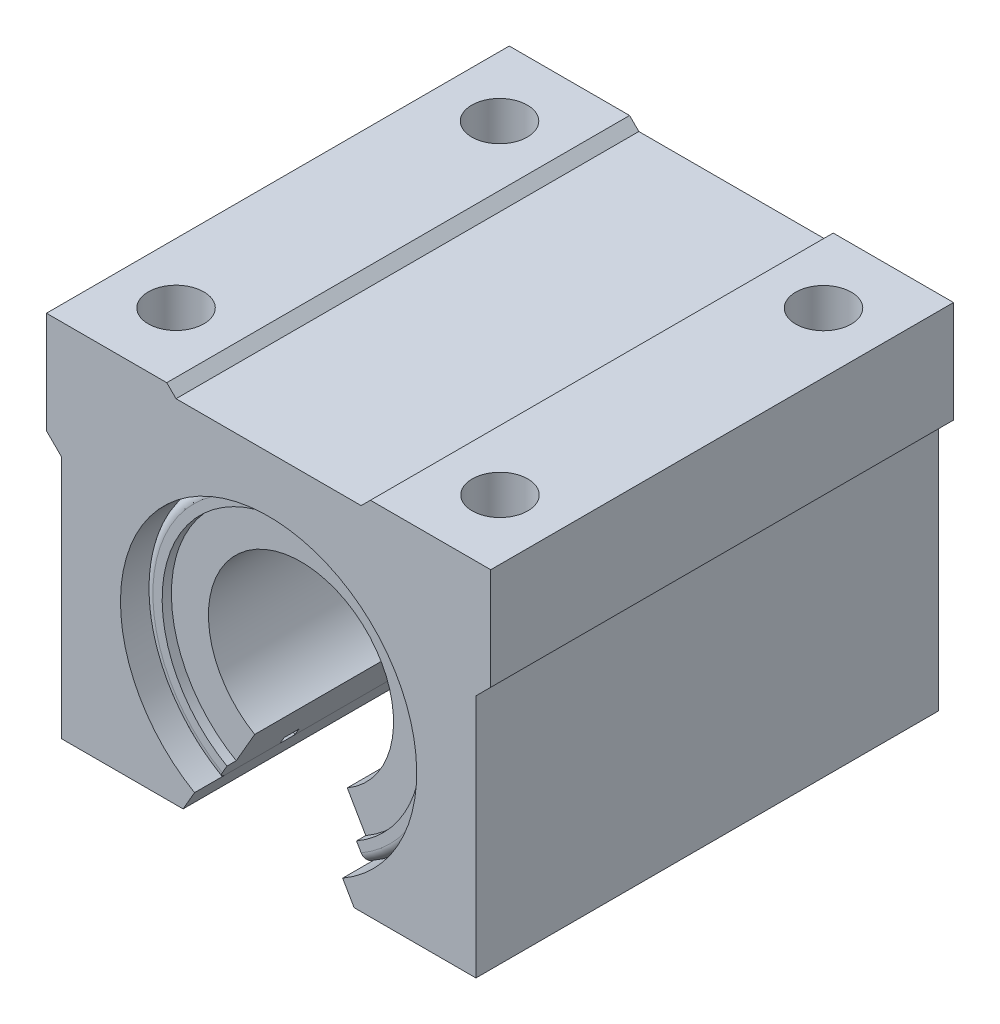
ISO-10303-21;
HEADER;
FILE_DESCRIPTION(('STEP AP214'),'2;1');
FILE_NAME('part.step','',(''),(''),'','','');
FILE_SCHEMA(('AUTOMOTIVE_DESIGN { 1 0 10303 214 1 1 1 1 }'));
ENDSEC;
DATA;
#1=APPLICATION_CONTEXT('core data for automotive mechanical design processes');
#2=APPLICATION_PROTOCOL_DEFINITION('international standard','automotive_design',2000,#1);
#3=PRODUCT_CONTEXT('',#1,'mechanical');
#4=PRODUCT('Part','Part','',(#3));
#5=PRODUCT_RELATED_PRODUCT_CATEGORY('part','',(#4));
#6=PRODUCT_DEFINITION_FORMATION('','',#4);
#7=PRODUCT_DEFINITION_CONTEXT('part definition',#1,'design');
#8=PRODUCT_DEFINITION('design','',#6,#7);
#9=PRODUCT_DEFINITION_SHAPE('','',#8);
#10=(LENGTH_UNIT() NAMED_UNIT(*) SI_UNIT(.MILLI.,.METRE.));
#11=(NAMED_UNIT(*) PLANE_ANGLE_UNIT() SI_UNIT($,.RADIAN.));
#12=(NAMED_UNIT(*) SI_UNIT($,.STERADIAN.) SOLID_ANGLE_UNIT());
#13=UNCERTAINTY_MEASURE_WITH_UNIT(LENGTH_MEASURE(1.E-05),#10,'distance_accuracy_value','');
#14=(GEOMETRIC_REPRESENTATION_CONTEXT(3) GLOBAL_UNCERTAINTY_ASSIGNED_CONTEXT((#13)) GLOBAL_UNIT_ASSIGNED_CONTEXT((#10,
#11,#12)) REPRESENTATION_CONTEXT('',''));
#15=CARTESIAN_POINT('',(0.,0.,0.));
#16=DIRECTION('',(0.,0.,1.));
#17=DIRECTION('',(1.,0.,0.));
#18=AXIS2_PLACEMENT_3D('',#15,#16,#17);
#19=CARTESIAN_POINT('',(0.,0.,-22.5));
#20=DIRECTION('',(0.,0.,1.));
#21=DIRECTION('',(1.,0.,0.));
#22=AXIS2_PLACEMENT_3D('',#19,#20,#21);
#23=PLANE('',#22);
#24=CARTESIAN_POINT('',(0.,0.,-22.5));
#25=DIRECTION('',(0.,0.,1.));
#26=DIRECTION('',(1.,0.,0.));
#27=AXIS2_PLACEMENT_3D('',#24,#25,#26);
#28=CIRCLE('',#27,15.);
#29=CARTESIAN_POINT('',(-7.50000000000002,-12.9903810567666,-22.5));
#30=VERTEX_POINT('',#29);
#31=CARTESIAN_POINT('',(14.9666295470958,1.,-22.5));
#32=VERTEX_POINT('',#31);
#33=EDGE_CURVE('P0_E321',#30,#32,#28,.F.);
#34=ORIENTED_EDGE('',*,*,#33,.T.);
#35=DIRECTION('',(-1.,0.,0.));
#36=VECTOR('',#35,1.);
#37=CARTESIAN_POINT('',(13.8,1.,-22.5));
#38=LINE('',#37,#36);
#39=CARTESIAN_POINT('',(13.9642400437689,1.,-22.5));
#40=VERTEX_POINT('',#39);
#41=EDGE_CURVE('P0_E507',#32,#40,#38,.T.);
#42=ORIENTED_EDGE('',*,*,#41,.T.);
#43=CARTESIAN_POINT('',(0.,0.,-22.5));
#44=DIRECTION('',(0.,0.,1.));
#45=DIRECTION('',(1.,0.,0.));
#46=AXIS2_PLACEMENT_3D('',#43,#44,#45);
#47=CIRCLE('',#46,14.);
#48=CARTESIAN_POINT('',(-7.00000000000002,-12.1243556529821,-22.5));
#49=VERTEX_POINT('',#48);
#50=EDGE_CURVE('P0_E364',#40,#49,#47,.T.);
#51=ORIENTED_EDGE('',*,*,#50,.T.);
#52=DIRECTION('',(-0.500000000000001,-0.866025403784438,0.));
#53=VECTOR('',#52,1.);
#54=CARTESIAN_POINT('',(0.,0.,-22.5));
#55=LINE('',#54,#53);
#56=EDGE_CURVE('P0_E426',#49,#30,#55,.T.);
#57=ORIENTED_EDGE('',*,*,#56,.T.);
#58=EDGE_LOOP('',(#34,#42,#51,#57));
#59=FACE_BOUND('',#58,.T.);
#60=ADVANCED_FACE('P0_F16',(#59),#23,.F.);
#61=CARTESIAN_POINT('',(0.,0.,22.5));
#62=DIRECTION('',(0.,0.,-1.));
#63=DIRECTION('',(-1.,0.,0.));
#64=AXIS2_PLACEMENT_3D('',#61,#62,#63);
#65=CYLINDRICAL_SURFACE('',#64,16.);
#66=CARTESIAN_POINT('',(0.,0.,14.15));
#67=DIRECTION('',(0.,0.,1.));
#68=DIRECTION('',(1.,0.,0.));
#69=AXIS2_PLACEMENT_3D('',#66,#67,#68);
#70=CIRCLE('',#69,16.);
#71=CARTESIAN_POINT('',(15.9687194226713,0.999999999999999,14.15));
#72=VERTEX_POINT('',#71);
#73=CARTESIAN_POINT('',(-8.00000000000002,-13.856406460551,14.15));
#74=VERTEX_POINT('',#73);
#75=EDGE_CURVE('P0_E300',#72,#74,#70,.T.);
#76=ORIENTED_EDGE('',*,*,#75,.F.);
#77=DIRECTION('',(0.,0.,-1.));
#78=VECTOR('',#77,1.);
#79=CARTESIAN_POINT('',(15.9687194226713,0.999999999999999,22.5));
#80=LINE('',#79,#78);
#81=CARTESIAN_POINT('',(15.9687194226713,0.999999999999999,-14.15));
#82=VERTEX_POINT('',#81);
#83=EDGE_CURVE('P0_E480',#72,#82,#80,.T.);
#84=ORIENTED_EDGE('',*,*,#83,.T.);
#85=CARTESIAN_POINT('',(0.,0.,-14.15));
#86=DIRECTION('',(0.,0.,1.));
#87=DIRECTION('',(1.,0.,0.));
#88=AXIS2_PLACEMENT_3D('',#85,#86,#87);
#89=CIRCLE('',#88,16.);
#90=CARTESIAN_POINT('',(-8.00000000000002,-13.856406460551,-14.15));
#91=VERTEX_POINT('',#90);
#92=EDGE_CURVE('P0_E296',#82,#91,#89,.T.);
#93=ORIENTED_EDGE('',*,*,#92,.T.);
#94=DIRECTION('',(0.,0.,1.));
#95=VECTOR('',#94,1.);
#96=CARTESIAN_POINT('',(-8.00000000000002,-13.856406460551,-22.5));
#97=LINE('',#96,#95);
#98=EDGE_CURVE('P0_E425',#91,#74,#97,.T.);
#99=ORIENTED_EDGE('',*,*,#98,.T.);
#100=EDGE_LOOP('',(#76,#84,#93,#99));
#101=FACE_BOUND('',#100,.T.);
#102=ADVANCED_FACE('P0_F611',(#101),#65,.T.);
#103=CARTESIAN_POINT('',(0.,0.,-15.75));
#104=DIRECTION('',(0.,0.,1.));
#105=DIRECTION('',(1.,0.,0.));
#106=AXIS2_PLACEMENT_3D('',#103,#104,#105);
#107=CIRCLE('',#106,16.);
#108=CARTESIAN_POINT('',(15.9687194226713,0.999999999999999,-15.75));
#109=VERTEX_POINT('',#108);
#110=CARTESIAN_POINT('',(-8.00000000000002,-13.856406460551,-15.75));
#111=VERTEX_POINT('',#110);
#112=EDGE_CURVE('P0_E292',#109,#111,#107,.T.);
#113=ORIENTED_EDGE('',*,*,#112,.F.);
#114=DIRECTION('',(0.,0.,-1.));
#115=VECTOR('',#114,1.);
#116=CARTESIAN_POINT('',(15.9687194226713,0.999999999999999,22.5));
#117=LINE('',#116,#115);
#118=CARTESIAN_POINT('',(15.9687194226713,0.999999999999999,-21.5));
#119=VERTEX_POINT('',#118);
#120=EDGE_CURVE('P0_E450',#109,#119,#117,.T.);
#121=ORIENTED_EDGE('',*,*,#120,.T.);
#122=CARTESIAN_POINT('',(0.,0.,-21.5));
#123=DIRECTION('',(0.,0.,1.));
#124=DIRECTION('',(1.,0.,0.));
#125=AXIS2_PLACEMENT_3D('',#122,#123,#124);
#126=CIRCLE('',#125,16.);
#127=CARTESIAN_POINT('',(-8.00000000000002,-13.856406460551,-21.5));
#128=VERTEX_POINT('',#127);
#129=EDGE_CURVE('P0_E316',#119,#128,#126,.T.);
#130=ORIENTED_EDGE('',*,*,#129,.T.);
#131=EDGE_CURVE('P0_E427',#128,#111,#97,.T.);
#132=ORIENTED_EDGE('',*,*,#131,.T.);
#133=EDGE_LOOP('',(#113,#121,#130,#132));
#134=FACE_BOUND('',#133,.T.);
#135=ADVANCED_FACE('P0_F493',(#134),#65,.T.);
#136=CARTESIAN_POINT('',(0.,0.,21.5));
#137=DIRECTION('',(0.,0.,1.));
#138=DIRECTION('',(1.,0.,0.));
#139=AXIS2_PLACEMENT_3D('',#136,#137,#138);
#140=CIRCLE('',#139,16.);
#141=CARTESIAN_POINT('',(-8.00000000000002,-13.856406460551,21.5));
#142=VERTEX_POINT('',#141);
#143=CARTESIAN_POINT('',(15.9687194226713,1.,21.5));
#144=VERTEX_POINT('',#143);
#145=EDGE_CURVE('P0_E327',#142,#144,#140,.F.);
#146=ORIENTED_EDGE('',*,*,#145,.T.);
#147=DIRECTION('',(0.,0.,-1.));
#148=VECTOR('',#147,1.);
#149=CARTESIAN_POINT('',(15.9687194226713,0.999999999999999,22.5));
#150=LINE('',#149,#148);
#151=CARTESIAN_POINT('',(15.9687194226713,0.999999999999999,15.75));
#152=VERTEX_POINT('',#151);
#153=EDGE_CURVE('P0_E469',#144,#152,#150,.T.);
#154=ORIENTED_EDGE('',*,*,#153,.T.);
#155=CARTESIAN_POINT('',(0.,0.,15.75));
#156=DIRECTION('',(0.,0.,1.));
#157=DIRECTION('',(1.,0.,0.));
#158=AXIS2_PLACEMENT_3D('',#155,#156,#157);
#159=CIRCLE('',#158,16.);
#160=CARTESIAN_POINT('',(-8.00000000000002,-13.856406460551,15.75));
#161=VERTEX_POINT('',#160);
#162=EDGE_CURVE('P0_E312',#152,#161,#159,.T.);
#163=ORIENTED_EDGE('',*,*,#162,.T.);
#164=EDGE_CURVE('P0_E422',#161,#142,#97,.T.);
#165=ORIENTED_EDGE('',*,*,#164,.T.);
#166=EDGE_LOOP('',(#146,#154,#163,#165));
#167=FACE_BOUND('',#166,.T.);
#168=ADVANCED_FACE('P0_F591',(#167),#65,.T.);
#169=CARTESIAN_POINT('',(0.,0.,22.5));
#170=DIRECTION('',(0.,0.,1.));
#171=DIRECTION('',(1.,0.,0.));
#172=AXIS2_PLACEMENT_3D('',#169,#170,#171);
#173=PLANE('',#172);
#174=DIRECTION('',(-1.,0.,0.));
#175=VECTOR('',#174,1.);
#176=CARTESIAN_POINT('',(13.8,1.,22.5));
#177=LINE('',#176,#175);
#178=CARTESIAN_POINT('',(14.9666295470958,1.,22.5));
#179=VERTEX_POINT('',#178);
#180=CARTESIAN_POINT('',(13.9642400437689,1.,22.5));
#181=VERTEX_POINT('',#180);
#182=EDGE_CURVE('P0_E271',#179,#181,#177,.T.);
#183=ORIENTED_EDGE('',*,*,#182,.F.);
#184=CARTESIAN_POINT('',(0.,0.,22.5));
#185=DIRECTION('',(0.,0.,1.));
#186=DIRECTION('',(1.,0.,0.));
#187=AXIS2_PLACEMENT_3D('',#184,#185,#186);
#188=CIRCLE('',#187,15.);
#189=CARTESIAN_POINT('',(-7.50000000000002,-12.9903810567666,22.5));
#190=VERTEX_POINT('',#189);
#191=EDGE_CURVE('P0_E324',#179,#190,#188,.T.);
#192=ORIENTED_EDGE('',*,*,#191,.T.);
#193=DIRECTION('',(-0.500000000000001,-0.866025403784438,0.));
#194=VECTOR('',#193,1.);
#195=CARTESIAN_POINT('',(0.,0.,22.5));
#196=LINE('',#195,#194);
#197=CARTESIAN_POINT('',(-7.00000000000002,-12.1243556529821,22.5));
#198=VERTEX_POINT('',#197);
#199=EDGE_CURVE('P0_E432',#198,#190,#196,.T.);
#200=ORIENTED_EDGE('',*,*,#199,.F.);
#201=CARTESIAN_POINT('',(0.,0.,22.5));
#202=DIRECTION('',(0.,0.,1.));
#203=DIRECTION('',(1.,0.,0.));
#204=AXIS2_PLACEMENT_3D('',#201,#202,#203);
#205=CIRCLE('',#204,14.);
#206=EDGE_CURVE('P0_E277',#181,#198,#205,.T.);
#207=ORIENTED_EDGE('',*,*,#206,.F.);
#208=EDGE_LOOP('',(#183,#192,#200,#207));
#209=FACE_BOUND('',#208,.T.);
#210=ADVANCED_FACE('P0_F582',(#209),#173,.T.);
#211=CARTESIAN_POINT('',(-1.1172740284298E-13,-16.,15.75));
#212=DIRECTION('',(0.,0.,-1.));
#213=DIRECTION('',(-1.,0.,0.));
#214=AXIS2_PLACEMENT_3D('',#211,#212,#213);
#215=PLANE('',#214);
#216=DIRECTION('',(1.,0.,0.));
#217=VECTOR('',#216,1.);
#218=CARTESIAN_POINT('',(-1.10051817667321E-13,1.,15.75));
#219=LINE('',#218,#217);
#220=CARTESIAN_POINT('',(15.1169606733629,0.999999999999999,15.75));
#221=VERTEX_POINT('',#220);
#222=EDGE_CURVE('P0_E474',#221,#152,#219,.T.);
#223=ORIENTED_EDGE('',*,*,#222,.F.);
#224=CARTESIAN_POINT('',(0.,0.,15.75));
#225=DIRECTION('',(0.,0.,1.));
#226=DIRECTION('',(1.,0.,0.));
#227=AXIS2_PLACEMENT_3D('',#224,#225,#226);
#228=CIRCLE('',#227,15.15);
#229=CARTESIAN_POINT('',(-7.57500000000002,-13.1202848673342,15.75));
#230=VERTEX_POINT('',#229);
#231=EDGE_CURVE('P0_E308',#221,#230,#228,.T.);
#232=ORIENTED_EDGE('',*,*,#231,.T.);
#233=DIRECTION('',(0.500000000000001,0.866025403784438,0.));
#234=VECTOR('',#233,1.);
#235=CARTESIAN_POINT('',(-6.92820323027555,-12.,15.75));
#236=LINE('',#235,#234);
#237=EDGE_CURVE('P0_E389',#161,#230,#236,.T.);
#238=ORIENTED_EDGE('',*,*,#237,.F.);
#239=ORIENTED_EDGE('',*,*,#162,.F.);
#240=EDGE_LOOP('',(#223,#232,#238,#239));
#241=FACE_BOUND('',#240,.T.);
#242=ADVANCED_FACE('P0_F597',(#241),#215,.T.);
#243=CARTESIAN_POINT('',(0.,0.,0.));
#244=DIRECTION('',(0.,0.,1.));
#245=DIRECTION('',(1.,0.,0.));
#246=AXIS2_PLACEMENT_3D('',#243,#244,#245);
#247=CYLINDRICAL_SURFACE('',#246,15.15);
#248=DIRECTION('',(0.,0.,1.));
#249=VECTOR('',#248,1.);
#250=CARTESIAN_POINT('',(15.1169606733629,0.999999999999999,0.));
#251=LINE('',#250,#249);
#252=CARTESIAN_POINT('',(15.1169606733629,0.999999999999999,14.15));
#253=VERTEX_POINT('',#252);
#254=EDGE_CURVE('P0_E476',#253,#221,#251,.T.);
#255=ORIENTED_EDGE('',*,*,#254,.F.);
#256=CARTESIAN_POINT('',(0.,0.,14.15));
#257=DIRECTION('',(0.,0.,1.));
#258=DIRECTION('',(1.,0.,0.));
#259=AXIS2_PLACEMENT_3D('',#256,#257,#258);
#260=CIRCLE('',#259,15.15);
#261=CARTESIAN_POINT('',(-7.57500000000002,-13.1202848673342,14.15));
#262=VERTEX_POINT('',#261);
#263=EDGE_CURVE('P0_E304',#253,#262,#260,.T.);
#264=ORIENTED_EDGE('',*,*,#263,.T.);
#265=DIRECTION('',(0.,0.,1.));
#266=VECTOR('',#265,1.);
#267=CARTESIAN_POINT('',(-7.57500000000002,-13.1202848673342,0.));
#268=LINE('',#267,#266);
#269=EDGE_CURVE('P0_E392',#230,#262,#268,.F.);
#270=ORIENTED_EDGE('',*,*,#269,.F.);
#271=ORIENTED_EDGE('',*,*,#231,.F.);
#272=EDGE_LOOP('',(#255,#264,#270,#271));
#273=FACE_BOUND('',#272,.T.);
#274=ADVANCED_FACE('P0_F601',(#273),#247,.T.);
#275=CARTESIAN_POINT('',(-1.05791884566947E-13,-15.15,14.15));
#276=DIRECTION('',(0.,0.,1.));
#277=DIRECTION('',(1.,0.,0.));
#278=AXIS2_PLACEMENT_3D('',#275,#276,#277);
#279=PLANE('',#278);
#280=DIRECTION('',(-1.,0.,0.));
#281=VECTOR('',#280,1.);
#282=CARTESIAN_POINT('',(-1.04200078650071E-13,1.,14.15));
#283=LINE('',#282,#281);
#284=EDGE_CURVE('P0_E478',#72,#253,#283,.T.);
#285=ORIENTED_EDGE('',*,*,#284,.F.);
#286=ORIENTED_EDGE('',*,*,#75,.T.);
#287=DIRECTION('',(-0.500000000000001,-0.866025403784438,0.));
#288=VECTOR('',#287,1.);
#289=CARTESIAN_POINT('',(-6.56014243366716,-11.3625,14.15));
#290=LINE('',#289,#288);
#291=EDGE_CURVE('P0_E395',#262,#74,#290,.T.);
#292=ORIENTED_EDGE('',*,*,#291,.F.);
#293=ORIENTED_EDGE('',*,*,#263,.F.);
#294=EDGE_LOOP('',(#285,#286,#292,#293));
#295=FACE_BOUND('',#294,.T.);
#296=ADVANCED_FACE('P0_F608',(#295),#279,.T.);
#297=CARTESIAN_POINT('',(-1.05791884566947E-13,-15.15,-14.15));
#298=DIRECTION('',(0.,0.,-1.));
#299=DIRECTION('',(-1.,0.,0.));
#300=AXIS2_PLACEMENT_3D('',#297,#298,#299);
#301=PLANE('',#300);
#302=DIRECTION('',(1.,0.,0.));
#303=VECTOR('',#302,1.);
#304=CARTESIAN_POINT('',(-1.04200078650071E-13,1.,-14.15));
#305=LINE('',#304,#303);
#306=CARTESIAN_POINT('',(15.1169606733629,0.999999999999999,-14.15));
#307=VERTEX_POINT('',#306);
#308=EDGE_CURVE('P0_E483',#307,#82,#305,.T.);
#309=ORIENTED_EDGE('',*,*,#308,.F.);
#310=CARTESIAN_POINT('',(0.,0.,-14.15));
#311=DIRECTION('',(0.,0.,1.));
#312=DIRECTION('',(1.,0.,0.));
#313=AXIS2_PLACEMENT_3D('',#310,#311,#312);
#314=CIRCLE('',#313,15.15);
#315=CARTESIAN_POINT('',(-7.57500000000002,-13.1202848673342,-14.15));
#316=VERTEX_POINT('',#315);
#317=EDGE_CURVE('P0_E288',#307,#316,#314,.T.);
#318=ORIENTED_EDGE('',*,*,#317,.T.);
#319=DIRECTION('',(0.500000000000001,0.866025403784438,0.));
#320=VECTOR('',#319,1.);
#321=CARTESIAN_POINT('',(-6.56014243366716,-11.3625,-14.15));
#322=LINE('',#321,#320);
#323=EDGE_CURVE('P0_E398',#91,#316,#322,.T.);
#324=ORIENTED_EDGE('',*,*,#323,.F.);
#325=ORIENTED_EDGE('',*,*,#92,.F.);
#326=EDGE_LOOP('',(#309,#318,#324,#325));
#327=FACE_BOUND('',#326,.T.);
#328=ADVANCED_FACE('P0_F617',(#327),#301,.T.);
#329=CARTESIAN_POINT('',(-1.1172740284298E-13,-16.,-15.75));
#330=DIRECTION('',(0.,0.,1.));
#331=DIRECTION('',(1.,0.,0.));
#332=AXIS2_PLACEMENT_3D('',#329,#330,#331);
#333=PLANE('',#332);
#334=DIRECTION('',(-1.,0.,0.));
#335=VECTOR('',#334,1.);
#336=CARTESIAN_POINT('',(-1.10051817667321E-13,1.,-15.75));
#337=LINE('',#336,#335);
#338=CARTESIAN_POINT('',(15.1169606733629,0.999999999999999,-15.75));
#339=VERTEX_POINT('',#338);
#340=EDGE_CURVE('P0_E486',#109,#339,#337,.T.);
#341=ORIENTED_EDGE('',*,*,#340,.F.);
#342=ORIENTED_EDGE('',*,*,#112,.T.);
#343=DIRECTION('',(-0.500000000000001,-0.866025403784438,0.));
#344=VECTOR('',#343,1.);
#345=CARTESIAN_POINT('',(-6.92820323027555,-12.,-15.75));
#346=LINE('',#345,#344);
#347=CARTESIAN_POINT('',(-7.57500000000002,-13.1202848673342,-15.75));
#348=VERTEX_POINT('',#347);
#349=EDGE_CURVE('P0_E401',#348,#111,#346,.T.);
#350=ORIENTED_EDGE('',*,*,#349,.F.);
#351=CARTESIAN_POINT('',(0.,0.,-15.75));
#352=DIRECTION('',(0.,0.,1.));
#353=DIRECTION('',(1.,0.,0.));
#354=AXIS2_PLACEMENT_3D('',#351,#352,#353);
#355=CIRCLE('',#354,15.15);
#356=EDGE_CURVE('P0_E287',#339,#348,#355,.T.);
#357=ORIENTED_EDGE('',*,*,#356,.F.);
#358=EDGE_LOOP('',(#341,#342,#350,#357));
#359=FACE_BOUND('',#358,.T.);
#360=ADVANCED_FACE('P0_F624',(#359),#333,.T.);
#361=CARTESIAN_POINT('',(0.,0.,0.));
#362=DIRECTION('',(0.,0.,1.));
#363=DIRECTION('',(1.,0.,0.));
#364=AXIS2_PLACEMENT_3D('',#361,#362,#363);
#365=CYLINDRICAL_SURFACE('',#364,15.15);
#366=DIRECTION('',(0.,0.,1.));
#367=VECTOR('',#366,1.);
#368=CARTESIAN_POINT('',(15.1169606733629,0.999999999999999,0.));
#369=LINE('',#368,#367);
#370=EDGE_CURVE('P0_E485',#339,#307,#369,.T.);
#371=ORIENTED_EDGE('',*,*,#370,.F.);
#372=ORIENTED_EDGE('',*,*,#356,.T.);
#373=DIRECTION('',(0.,0.,1.));
#374=VECTOR('',#373,1.);
#375=CARTESIAN_POINT('',(-7.57500000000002,-13.1202848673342,0.));
#376=LINE('',#375,#374);
#377=EDGE_CURVE('P0_E404',#316,#348,#376,.F.);
#378=ORIENTED_EDGE('',*,*,#377,.F.);
#379=ORIENTED_EDGE('',*,*,#317,.F.);
#380=EDGE_LOOP('',(#371,#372,#378,#379));
#381=FACE_BOUND('',#380,.T.);
#382=ADVANCED_FACE('P0_F620',(#381),#365,.T.);
#383=CARTESIAN_POINT('',(0.,0.,-21.5));
#384=DIRECTION('',(0.,0.,1.));
#385=DIRECTION('',(1.,0.,0.));
#386=AXIS2_PLACEMENT_3D('',#383,#384,#385);
#387=TOROIDAL_SURFACE('',#386,15.,1.);
#388=CARTESIAN_POINT('',(14.2000570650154,1.,-22.1442970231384));
#389=CARTESIAN_POINT('',(14.2363914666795,1.,-22.1873152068));
#390=CARTESIAN_POINT('',(14.2763920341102,1.,-22.227291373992));
#391=CARTESIAN_POINT('',(14.3625742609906,1.,-22.2999893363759));
#392=CARTESIAN_POINT('',(14.4087634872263,1.,-22.332702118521));
#393=CARTESIAN_POINT('',(14.5059543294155,1.,-22.3898965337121));
#394=CARTESIAN_POINT('',(14.5569532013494,1.,-22.4143828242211));
#395=CARTESIAN_POINT('',(14.6623196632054,1.,-22.4544522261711));
#396=CARTESIAN_POINT('',(14.716686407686,1.,-22.4700375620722));
#397=CARTESIAN_POINT('',(14.8273451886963,1.,-22.4918962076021));
#398=CARTESIAN_POINT('',(14.8836399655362,1.,-22.4981556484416));
#399=CARTESIAN_POINT('',(14.99648420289,1.,-22.5011415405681));
#400=CARTESIAN_POINT('',(15.0530336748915,1.,-22.497867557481));
#401=CARTESIAN_POINT('',(15.1648160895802,1.,-22.4818709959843));
#402=CARTESIAN_POINT('',(15.2200481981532,1.,-22.469142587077));
#403=CARTESIAN_POINT('',(15.3275886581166,1.,-22.434586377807));
#404=CARTESIAN_POINT('',(15.3798970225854,1.,-22.4127586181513));
#405=CARTESIAN_POINT('',(15.4800580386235,1.,-22.3606384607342));
#406=CARTESIAN_POINT('',(15.5279142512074,1.,-22.3303529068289));
#407=CARTESIAN_POINT('',(15.6178509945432,1.,-22.2621638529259));
#408=CARTESIAN_POINT('',(15.6599315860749,1.,-22.2242604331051));
#409=CARTESIAN_POINT('',(15.7370415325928,1.,-22.1419830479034));
#410=CARTESIAN_POINT('',(15.7720833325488,1.,-22.0976207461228));
#411=CARTESIAN_POINT('',(15.8342042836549,1.,-22.0036330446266));
#412=CARTESIAN_POINT('',(15.8612835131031,1.,-21.9540076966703));
#413=CARTESIAN_POINT('',(15.9066552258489,1.,-21.8510080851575));
#414=CARTESIAN_POINT('',(15.9249649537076,1.,-21.7976414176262));
#415=CARTESIAN_POINT('',(15.9523508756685,1.,-21.6885893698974));
#416=CARTESIAN_POINT('',(15.9614271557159,1.,-21.6329040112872));
#417=CARTESIAN_POINT('',(15.9700790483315,1.,-21.520878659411));
#418=CARTESIAN_POINT('',(15.9696679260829,1.,-21.4645396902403));
#419=CARTESIAN_POINT('',(15.9593895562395,1.,-21.3527312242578));
#420=CARTESIAN_POINT('',(15.9495223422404,1.,-21.2972617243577));
#421=CARTESIAN_POINT('',(15.9206197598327,1.,-21.1887845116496));
#422=CARTESIAN_POINT('',(15.9015873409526,1.,-21.13577601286));
#423=CARTESIAN_POINT('',(15.8549007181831,1.,-21.0337027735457));
#424=CARTESIAN_POINT('',(15.8272464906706,1.,-20.9846380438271));
#425=CARTESIAN_POINT('',(15.7640787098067,1.,-20.8917976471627));
#426=CARTESIAN_POINT('',(15.7285583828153,1.,-20.8480265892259));
#427=CARTESIAN_POINT('',(15.6506850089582,1.,-20.767056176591));
#428=CARTESIAN_POINT('',(15.6083319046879,1.,-20.7298568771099));
#429=CARTESIAN_POINT('',(15.517916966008,1.,-20.6630154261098));
#430=CARTESIAN_POINT('',(15.4698452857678,1.,-20.6333865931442));
#431=CARTESIAN_POINT('',(15.3694175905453,1.,-20.5826014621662));
#432=CARTESIAN_POINT('',(15.3170615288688,1.,-20.561445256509));
#433=CARTESIAN_POINT('',(15.2094397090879,1.,-20.5281627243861));
#434=CARTESIAN_POINT('',(15.1541683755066,1.,-20.5160544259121));
#435=CARTESIAN_POINT('',(15.0423779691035,1.,-20.5012743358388));
#436=CARTESIAN_POINT('',(14.9858588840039,1.,-20.4986026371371));
#437=CARTESIAN_POINT('',(14.8730918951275,1.,-20.5027721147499));
#438=CARTESIAN_POINT('',(14.8168444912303,1.,-20.5096268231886));
#439=CARTESIAN_POINT('',(14.7062980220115,1.,-20.5326800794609));
#440=CARTESIAN_POINT('',(14.6519989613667,1.,-20.5488786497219));
#441=CARTESIAN_POINT('',(14.5468828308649,1.,-20.5901681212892));
#442=CARTESIAN_POINT('',(14.4960663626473,1.,-20.615260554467));
#443=CARTESIAN_POINT('',(14.3993744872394,1.,-20.6736312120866));
#444=CARTESIAN_POINT('',(14.3534990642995,1.,-20.7069094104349));
#445=CARTESIAN_POINT('',(14.2680582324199,1.,-20.7806640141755));
#446=CARTESIAN_POINT('',(14.2284847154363,1.,-20.8211310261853));
#447=CARTESIAN_POINT('',(14.1567119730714,1.,-20.9081479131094));
#448=CARTESIAN_POINT('',(14.1245126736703,1.,-20.9546977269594));
#449=CARTESIAN_POINT('',(14.0684810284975,1.,-21.0524461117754));
#450=CARTESIAN_POINT('',(14.0446298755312,1.,-21.1036339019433));
#451=CARTESIAN_POINT('',(14.0058825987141,1.,-21.2092912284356));
#452=CARTESIAN_POINT('',(13.9909860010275,1.,-21.2637605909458));
#453=CARTESIAN_POINT('',(13.9706009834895,1.,-21.3743012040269));
#454=CARTESIAN_POINT('',(13.9650908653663,1.,-21.4303684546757));
#455=CARTESIAN_POINT('',(13.9635717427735,1.,-21.5426466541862));
#456=CARTESIAN_POINT('',(13.9675650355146,1.,-21.5988576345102));
#457=CARTESIAN_POINT('',(13.984933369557,1.,-21.7097750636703));
#458=CARTESIAN_POINT('',(13.9983035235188,1.,-21.7644822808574));
#459=CARTESIAN_POINT('',(14.0340285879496,1.,-21.8708290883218));
#460=CARTESIAN_POINT('',(14.0563726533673,1.,-21.9224722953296));
#461=CARTESIAN_POINT('',(14.0993222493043,1.,-22.0025339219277));
#462=CARTESIAN_POINT('',(14.1173853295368,1.,-22.0323450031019));
#463=CARTESIAN_POINT('',(14.1565172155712,1.,-22.0899242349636));
#464=CARTESIAN_POINT('',(14.1775860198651,1.,-22.1176923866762));
#465=CARTESIAN_POINT('',(14.2000570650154,1.,-22.1442970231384));
#466=B_SPLINE_CURVE_WITH_KNOTS('',3,(#388,#389,#390,#391,#392,#393,#394,#395,#396,#397,#398,
#399,#400,#401,#402,#403,#404,#405,#406,#407,#408,#409,#410,#411,#412,#413,#414,#415,#416,#417,
#418,#419,#420,#421,#422,#423,#424,#425,#426,#427,#428,#429,#430,#431,#432,#433,#434,#435,#436,
#437,#438,#439,#440,#441,#442,#443,#444,#445,#446,#447,#448,#449,#450,#451,#452,#453,#454,#455,
#456,#457,#458,#459,#460,#461,#462,#463,#464,#465),.UNSPECIFIED.,.T.,.F.,(4,2,2,2,2,2,2,2,2,2,2,
2,2,2,2,2,2,2,2,2,2,2,2,2,2,2,2,2,2,2,2,2,2,2,2,2,2,2,4),(0.,0.16880084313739,0.337809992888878,
0.506723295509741,0.675594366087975,0.844716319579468,1.0138459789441,1.18308002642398,
1.35231331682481,1.52141006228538,1.69050502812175,1.8592983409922,2.02808999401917,
2.19654835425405,2.36500514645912,2.53322641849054,2.70144709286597,2.86961366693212,
3.0377807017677,3.20609311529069,3.37440694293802,3.54301487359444,3.71162464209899,
3.88056947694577,4.04951597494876,4.21870270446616,4.38788984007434,4.55710613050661,
4.72632188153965,4.8953181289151,5.06431267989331,5.23292402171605,5.40152644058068,
5.56973857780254,5.73799138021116,5.90615655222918,6.07411910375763,6.17851419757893,
6.282909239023),.UNSPECIFIED.);
#467=EDGE_CURVE('P0_E444',#32,#119,#466,.T.);
#468=ORIENTED_EDGE('',*,*,#467,.F.);
#469=ORIENTED_EDGE('',*,*,#33,.F.);
#470=CARTESIAN_POINT('',(-7.50000000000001,-12.9903810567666,-21.5));
#471=DIRECTION('',(-0.866025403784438,0.500000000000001,0.));
#472=DIRECTION('',(-0.500000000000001,-0.866025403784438,0.));
#473=AXIS2_PLACEMENT_3D('',#470,#471,#472);
#474=CIRCLE('',#473,1.);
#475=EDGE_CURVE('P0_E407',#128,#30,#474,.F.);
#476=ORIENTED_EDGE('',*,*,#475,.F.);
#477=ORIENTED_EDGE('',*,*,#129,.F.);
#478=EDGE_LOOP('',(#468,#469,#476,#477));
#479=FACE_BOUND('',#478,.T.);
#480=ADVANCED_FACE('P0_F499',(#479),#387,.T.);
#481=CARTESIAN_POINT('',(0.,0.,21.5));
#482=DIRECTION('',(0.,0.,1.));
#483=DIRECTION('',(1.,0.,0.));
#484=AXIS2_PLACEMENT_3D('',#481,#482,#483);
#485=TOROIDAL_SURFACE('',#484,15.,1.);
#486=CARTESIAN_POINT('',(14.0016613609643,1.,21.7706635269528));
#487=CARTESIAN_POINT('',(13.9864605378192,1.,21.7167266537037));
#488=CARTESIAN_POINT('',(13.975801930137,1.,21.6614675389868));
#489=CARTESIAN_POINT('',(13.963907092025,1.,21.5498985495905));
#490=CARTESIAN_POINT('',(13.9626820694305,1.,21.4935875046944));
#491=CARTESIAN_POINT('',(13.9697075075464,1.,21.3815813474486));
#492=CARTESIAN_POINT('',(13.977953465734,1.,21.3258859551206));
#493=CARTESIAN_POINT('',(14.0036750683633,1.,21.2166849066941));
#494=CARTESIAN_POINT('',(14.0211484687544,1.,21.1631787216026));
#495=CARTESIAN_POINT('',(14.0648279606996,1.,21.0598361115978));
#496=CARTESIAN_POINT('',(14.0910371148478,1.,21.0100009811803));
#497=CARTESIAN_POINT('',(14.1514366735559,1.,20.9154257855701));
#498=CARTESIAN_POINT('',(14.1856274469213,1.,20.8706859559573));
#499=CARTESIAN_POINT('',(14.2610821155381,1.,20.7874858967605));
#500=CARTESIAN_POINT('',(14.3023585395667,1.,20.7490370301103));
#501=CARTESIAN_POINT('',(14.3907670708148,1.,20.6795947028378));
#502=CARTESIAN_POINT('',(14.4378992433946,1.,20.6486013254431));
#503=CARTESIAN_POINT('',(14.5368030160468,1.,20.5948717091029));
#504=CARTESIAN_POINT('',(14.5885854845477,1.,20.5721554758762));
#505=CARTESIAN_POINT('',(14.6952246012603,1.,20.5357208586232));
#506=CARTESIAN_POINT('',(14.7500812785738,1.,20.522002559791));
#507=CARTESIAN_POINT('',(14.8614193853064,1.,20.5039314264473));
#508=CARTESIAN_POINT('',(14.9179036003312,1.,20.4995957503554));
#509=CARTESIAN_POINT('',(15.0307989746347,1.,20.5004636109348));
#510=CARTESIAN_POINT('',(15.087210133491,1.,20.5056672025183));
#511=CARTESIAN_POINT('',(15.1983859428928,1.,20.5254742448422));
#512=CARTESIAN_POINT('',(15.2531497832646,1.,20.5400822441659));
#513=CARTESIAN_POINT('',(15.3594440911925,1.,20.5782934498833));
#514=CARTESIAN_POINT('',(15.4109745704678,1.,20.6018966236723));
#515=CARTESIAN_POINT('',(15.5092857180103,1.,20.6574079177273));
#516=CARTESIAN_POINT('',(15.5560707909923,1.,20.6893082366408));
#517=CARTESIAN_POINT('',(15.6436085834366,1.,20.7605241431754));
#518=CARTESIAN_POINT('',(15.6843613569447,1.,20.7998396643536));
#519=CARTESIAN_POINT('',(15.7585968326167,1.,20.8846930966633));
#520=CARTESIAN_POINT('',(15.7920927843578,1.,20.9302194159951));
#521=CARTESIAN_POINT('',(15.850948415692,1.,21.0262583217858));
#522=CARTESIAN_POINT('',(15.8763081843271,1.,21.0767708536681));
#523=CARTESIAN_POINT('',(15.9181208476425,1.,21.1812423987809));
#524=CARTESIAN_POINT('',(15.9345909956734,1.,21.2351945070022));
#525=CARTESIAN_POINT('',(15.9582264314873,1.,21.345099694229));
#526=CARTESIAN_POINT('',(15.9653917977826,1.,21.4010527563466));
#527=CARTESIAN_POINT('',(15.9702084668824,1.,21.5132933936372));
#528=CARTESIAN_POINT('',(15.967872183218,1.,21.569580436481));
#529=CARTESIAN_POINT('',(15.9537807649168,1.,21.6809626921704));
#530=CARTESIAN_POINT('',(15.9420256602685,1.,21.73605790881));
#531=CARTESIAN_POINT('',(15.9094372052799,1.,21.8434822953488));
#532=CARTESIAN_POINT('',(15.8886056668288,1.,21.8958120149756));
#533=CARTESIAN_POINT('',(15.8384611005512,1.,21.9962361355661));
#534=CARTESIAN_POINT('',(15.8091480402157,1.,22.0443305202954));
#535=CARTESIAN_POINT('',(15.7428447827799,1.,22.1349709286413));
#536=CARTESIAN_POINT('',(15.7058471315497,1.,22.1775114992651));
#537=CARTESIAN_POINT('',(15.6252466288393,1.,22.2557911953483));
#538=CARTESIAN_POINT('',(15.5816437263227,1.,22.2915302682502));
#539=CARTESIAN_POINT('',(15.4889869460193,1.,22.3552622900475));
#540=CARTESIAN_POINT('',(15.4399233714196,1.,22.383241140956));
#541=CARTESIAN_POINT('',(15.3378021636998,1.,22.4305833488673));
#542=CARTESIAN_POINT('',(15.2847444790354,1.,22.4499465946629));
#543=CARTESIAN_POINT('',(15.1760294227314,1.,22.4795464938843));
#544=CARTESIAN_POINT('',(15.1203671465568,1.,22.4897651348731));
#545=CARTESIAN_POINT('',(15.0081170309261,1.,22.5007261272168));
#546=CARTESIAN_POINT('',(14.951529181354,1.,22.501468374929));
#547=CARTESIAN_POINT('',(14.8389540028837,1.,22.4934516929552));
#548=CARTESIAN_POINT('',(14.7829675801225,1.,22.4846800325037));
#549=CARTESIAN_POINT('',(14.6732637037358,1.,22.4578626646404));
#550=CARTESIAN_POINT('',(14.6195461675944,1.,22.4398172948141));
#551=CARTESIAN_POINT('',(14.5159093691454,1.,22.3949621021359));
#552=CARTESIAN_POINT('',(14.465989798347,1.,22.3681529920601));
#553=CARTESIAN_POINT('',(14.3713554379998,1.,22.3065149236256));
#554=CARTESIAN_POINT('',(14.3266419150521,1.,22.2716840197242));
#555=CARTESIAN_POINT('',(14.243757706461,1.,22.1950337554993));
#556=CARTESIAN_POINT('',(14.2055808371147,1.,22.1532210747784));
#557=CARTESIAN_POINT('',(14.1368474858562,1.,22.0637972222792));
#558=CARTESIAN_POINT('',(14.1062817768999,1.,22.0161931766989));
#559=CARTESIAN_POINT('',(14.0635002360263,1.,21.9352651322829));
#560=CARTESIAN_POINT('',(14.0487010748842,1.,21.903278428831));
#561=CARTESIAN_POINT('',(14.0225572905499,1.,21.8379230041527));
#562=CARTESIAN_POINT('',(14.0112126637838,1.,21.8045542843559));
#563=CARTESIAN_POINT('',(14.0016613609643,1.,21.7706635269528));
#564=B_SPLINE_CURVE_WITH_KNOTS('',3,(#486,#487,#488,#489,#490,#491,#492,#493,#494,#495,#496,
#497,#498,#499,#500,#501,#502,#503,#504,#505,#506,#507,#508,#509,#510,#511,#512,#513,#514,#515,
#516,#517,#518,#519,#520,#521,#522,#523,#524,#525,#526,#527,#528,#529,#530,#531,#532,#533,#534,
#535,#536,#537,#538,#539,#540,#541,#542,#543,#544,#545,#546,#547,#548,#549,#550,#551,#552,#553,
#554,#555,#556,#557,#558,#559,#560,#561,#562,#563),.UNSPECIFIED.,.T.,.F.,(4,2,2,2,2,2,2,2,2,2,2,
2,2,2,2,2,2,2,2,2,2,2,2,2,2,2,2,2,2,2,2,2,2,2,2,2,2,2,4),(0.,0.16798537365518,0.336170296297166,
0.504275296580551,0.672339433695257,0.84046255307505,1.0085934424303,1.17702474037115,
1.3454579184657,1.51429553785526,1.68313475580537,1.85228247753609,2.02143117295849,
2.19066174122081,2.35989169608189,2.52896310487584,2.69803299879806,2.86679155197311,
3.03554825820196,3.20397624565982,3.37240281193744,3.54060940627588,3.70881546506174,
3.876987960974,4.04516110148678,4.21349813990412,4.38183647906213,4.55047866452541,
4.7191230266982,4.88809884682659,5.05707651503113,5.22628057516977,5.39547847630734,
5.564662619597,5.73388783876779,5.90295207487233,6.07181034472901,6.17736257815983,
6.28291470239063),.UNSPECIFIED.);
#565=EDGE_CURVE('P0_E463',#144,#179,#564,.T.);
#566=ORIENTED_EDGE('',*,*,#565,.F.);
#567=ORIENTED_EDGE('',*,*,#145,.F.);
#568=CARTESIAN_POINT('',(-7.50000000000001,-12.9903810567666,21.5));
#569=DIRECTION('',(-0.866025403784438,0.500000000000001,0.));
#570=DIRECTION('',(-0.500000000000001,-0.866025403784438,0.));
#571=AXIS2_PLACEMENT_3D('',#568,#569,#570);
#572=CIRCLE('',#571,1.);
#573=EDGE_CURVE('P0_E409',#190,#142,#572,.F.);
#574=ORIENTED_EDGE('',*,*,#573,.F.);
#575=ORIENTED_EDGE('',*,*,#191,.F.);
#576=EDGE_LOOP('',(#566,#567,#574,#575));
#577=FACE_BOUND('',#576,.T.);
#578=ADVANCED_FACE('P0_F589',(#577),#485,.T.);
#579=CARTESIAN_POINT('',(0.,0.,21.5));
#580=DIRECTION('',(0.,0.,1.));
#581=DIRECTION('',(1.,0.,0.));
#582=AXIS2_PLACEMENT_3D('',#579,#580,#581);
#583=CYLINDRICAL_SURFACE('',#582,14.);
#584=CARTESIAN_POINT('',(0.,0.,21.5));
#585=DIRECTION('',(0.,0.,1.));
#586=DIRECTION('',(1.,0.,0.));
#587=AXIS2_PLACEMENT_3D('',#584,#585,#586);
#588=CIRCLE('',#587,14.);
#589=CARTESIAN_POINT('',(13.9642400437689,1.,21.5));
#590=VERTEX_POINT('',#589);
#591=CARTESIAN_POINT('',(-7.00000000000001,-12.1243556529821,21.5));
#592=VERTEX_POINT('',#591);
#593=EDGE_CURVE('P0_E276',#590,#592,#588,.T.);
#594=ORIENTED_EDGE('',*,*,#593,.F.);
#595=DIRECTION('',(0.,0.,1.));
#596=VECTOR('',#595,1.);
#597=CARTESIAN_POINT('',(13.9642400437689,1.,21.5));
#598=LINE('',#597,#596);
#599=EDGE_CURVE('P0_E470',#590,#181,#598,.T.);
#600=ORIENTED_EDGE('',*,*,#599,.T.);
#601=ORIENTED_EDGE('',*,*,#206,.T.);
#602=DIRECTION('',(0.,0.,1.));
#603=VECTOR('',#602,1.);
#604=CARTESIAN_POINT('',(-7.00000000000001,-12.1243556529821,21.5));
#605=LINE('',#604,#603);
#606=EDGE_CURVE('P0_E411',#198,#592,#605,.F.);
#607=ORIENTED_EDGE('',*,*,#606,.T.);
#608=EDGE_LOOP('',(#594,#600,#601,#607));
#609=FACE_BOUND('',#608,.T.);
#610=ADVANCED_FACE('P0_F577',(#609),#583,.F.);
#611=CARTESIAN_POINT('',(0.,0.,-21.5));
#612=DIRECTION('',(0.,0.,-1.));
#613=DIRECTION('',(-1.,0.,0.));
#614=AXIS2_PLACEMENT_3D('',#611,#612,#613);
#615=CYLINDRICAL_SURFACE('',#614,14.);
#616=DIRECTION('',(0.,0.,-1.));
#617=VECTOR('',#616,1.);
#618=CARTESIAN_POINT('',(13.9642400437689,1.,-21.5));
#619=LINE('',#618,#617);
#620=CARTESIAN_POINT('',(13.9642400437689,1.,-21.5));
#621=VERTEX_POINT('',#620);
#622=EDGE_CURVE('P0_E509',#621,#40,#619,.T.);
#623=ORIENTED_EDGE('',*,*,#622,.F.);
#624=CARTESIAN_POINT('',(0.,0.,-21.5));
#625=DIRECTION('',(0.,0.,1.));
#626=DIRECTION('',(1.,0.,0.));
#627=AXIS2_PLACEMENT_3D('',#624,#625,#626);
#628=CIRCLE('',#627,14.);
#629=CARTESIAN_POINT('',(-7.00000000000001,-12.1243556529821,-21.5));
#630=VERTEX_POINT('',#629);
#631=EDGE_CURVE('P0_E40',#621,#630,#628,.T.);
#632=ORIENTED_EDGE('',*,*,#631,.T.);
#633=DIRECTION('',(0.,0.,-1.));
#634=VECTOR('',#633,1.);
#635=CARTESIAN_POINT('',(-7.00000000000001,-12.1243556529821,-21.5));
#636=LINE('',#635,#634);
#637=EDGE_CURVE('P0_E419',#49,#630,#636,.F.);
#638=ORIENTED_EDGE('',*,*,#637,.F.);
#639=ORIENTED_EDGE('',*,*,#50,.F.);
#640=EDGE_LOOP('',(#623,#632,#638,#639));
#641=FACE_BOUND('',#640,.T.);
#642=ADVANCED_FACE('P0_F508',(#641),#615,.F.);
#643=CARTESIAN_POINT('',(0.,0.,22.5));
#644=DIRECTION('',(0.,0.,-1.));
#645=DIRECTION('',(-1.,0.,0.));
#646=AXIS2_PLACEMENT_3D('',#643,#644,#645);
#647=CYLINDRICAL_SURFACE('',#646,10.);
#648=DIRECTION('',(0.,0.,-1.));
#649=VECTOR('',#648,1.);
#650=CARTESIAN_POINT('',(5.00000000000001,-8.66025403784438,22.5));
#651=LINE('',#650,#649);
#652=CARTESIAN_POINT('',(5.00000000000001,-8.66025403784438,21.5));
#653=VERTEX_POINT('',#652);
#654=CARTESIAN_POINT('',(5.00000000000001,-8.66025403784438,-21.5));
#655=VERTEX_POINT('',#654);
#656=EDGE_CURVE('P0_E385',#653,#655,#651,.T.);
#657=ORIENTED_EDGE('',*,*,#656,.F.);
#658=CARTESIAN_POINT('',(0.,0.,21.5));
#659=DIRECTION('',(0.,0.,1.));
#660=DIRECTION('',(1.,0.,0.));
#661=AXIS2_PLACEMENT_3D('',#658,#659,#660);
#662=CIRCLE('',#661,10.);
#663=CARTESIAN_POINT('',(-5.00000000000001,-8.66025403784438,21.5));
#664=VERTEX_POINT('',#663);
#665=EDGE_CURVE('P0_E331',#653,#664,#662,.T.);
#666=ORIENTED_EDGE('',*,*,#665,.T.);
#667=DIRECTION('',(0.,0.,-1.));
#668=VECTOR('',#667,1.);
#669=CARTESIAN_POINT('',(-5.00000000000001,-8.66025403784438,22.5));
#670=LINE('',#669,#668);
#671=CARTESIAN_POINT('',(-5.00000000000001,-8.66025403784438,-21.5));
#672=VERTEX_POINT('',#671);
#673=EDGE_CURVE('P0_E417',#672,#664,#670,.F.);
#674=ORIENTED_EDGE('',*,*,#673,.F.);
#675=CARTESIAN_POINT('',(0.,0.,-21.5));
#676=DIRECTION('',(0.,0.,-1.));
#677=DIRECTION('',(-1.,0.,0.));
#678=AXIS2_PLACEMENT_3D('',#675,#676,#677);
#679=CIRCLE('',#678,10.);
#680=EDGE_CURVE('P0_E281',#672,#655,#679,.T.);
#681=ORIENTED_EDGE('',*,*,#680,.T.);
#682=EDGE_LOOP('',(#657,#666,#674,#681));
#683=FACE_BOUND('',#682,.T.);
#684=ADVANCED_FACE('P0_F514',(#683),#647,.F.);
#685=CARTESIAN_POINT('',(7.00000000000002,-12.1243556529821,-22.5));
#686=VERTEX_POINT('',#685);
#687=CARTESIAN_POINT('',(13.9642400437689,-1.,-22.5));
#688=VERTEX_POINT('',#687);
#689=EDGE_CURVE('P0_E360',#686,#688,#47,.T.);
#690=ORIENTED_EDGE('',*,*,#689,.T.);
#691=DIRECTION('',(1.,0.,0.));
#692=VECTOR('',#691,1.);
#693=CARTESIAN_POINT('',(13.8,-1.,-22.5));
#694=LINE('',#693,#692);
#695=CARTESIAN_POINT('',(14.9666295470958,-1.,-22.5));
#696=VERTEX_POINT('',#695);
#697=EDGE_CURVE('P0_E527',#688,#696,#694,.T.);
#698=ORIENTED_EDGE('',*,*,#697,.T.);
#699=CARTESIAN_POINT('',(7.50000000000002,-12.9903810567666,-22.5));
#700=VERTEX_POINT('',#699);
#701=EDGE_CURVE('P0_E320',#696,#700,#28,.F.);
#702=ORIENTED_EDGE('',*,*,#701,.T.);
#703=DIRECTION('',(-0.500000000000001,0.866025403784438,0.));
#704=VECTOR('',#703,1.);
#705=CARTESIAN_POINT('',(0.,0.,-22.5));
#706=LINE('',#705,#704);
#707=EDGE_CURVE('P0_E435',#700,#686,#706,.T.);
#708=ORIENTED_EDGE('',*,*,#707,.T.);
#709=EDGE_LOOP('',(#690,#698,#702,#708));
#710=FACE_BOUND('',#709,.T.);
#711=ADVANCED_FACE('P0_F526',(#710),#23,.F.);
#712=CARTESIAN_POINT('',(8.00000000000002,-13.856406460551,-14.15));
#713=VERTEX_POINT('',#712);
#714=CARTESIAN_POINT('',(15.9687194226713,-0.999999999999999,-14.15));
#715=VERTEX_POINT('',#714);
#716=EDGE_CURVE('P0_E297',#713,#715,#89,.T.);
#717=ORIENTED_EDGE('',*,*,#716,.T.);
#718=DIRECTION('',(0.,0.,-1.));
#719=VECTOR('',#718,1.);
#720=CARTESIAN_POINT('',(15.9687194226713,-0.999999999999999,22.5));
#721=LINE('',#720,#719);
#722=CARTESIAN_POINT('',(15.9687194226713,-1.,14.15));
#723=VERTEX_POINT('',#722);
#724=EDGE_CURVE('P0_E554',#715,#723,#721,.F.);
#725=ORIENTED_EDGE('',*,*,#724,.T.);
#726=CARTESIAN_POINT('',(8.00000000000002,-13.856406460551,14.15));
#727=VERTEX_POINT('',#726);
#728=EDGE_CURVE('P0_E301',#727,#723,#70,.T.);
#729=ORIENTED_EDGE('',*,*,#728,.F.);
#730=DIRECTION('',(0.,0.,1.));
#731=VECTOR('',#730,1.);
#732=CARTESIAN_POINT('',(8.00000000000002,-13.856406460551,-22.5));
#733=LINE('',#732,#731);
#734=EDGE_CURVE('P0_E431',#713,#727,#733,.T.);
#735=ORIENTED_EDGE('',*,*,#734,.F.);
#736=EDGE_LOOP('',(#717,#725,#729,#735));
#737=FACE_BOUND('',#736,.T.);
#738=ADVANCED_FACE('P0_F553',(#737),#65,.T.);
#739=CARTESIAN_POINT('',(8.00000000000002,-13.856406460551,-21.5));
#740=VERTEX_POINT('',#739);
#741=CARTESIAN_POINT('',(15.9687194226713,-0.999999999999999,-21.5));
#742=VERTEX_POINT('',#741);
#743=EDGE_CURVE('P0_E317',#740,#742,#126,.T.);
#744=ORIENTED_EDGE('',*,*,#743,.T.);
#745=DIRECTION('',(0.,0.,-1.));
#746=VECTOR('',#745,1.);
#747=CARTESIAN_POINT('',(15.9687194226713,-0.999999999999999,22.5));
#748=LINE('',#747,#746);
#749=CARTESIAN_POINT('',(15.9687194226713,-1.,-15.75));
#750=VERTEX_POINT('',#749);
#751=EDGE_CURVE('P0_E539',#742,#750,#748,.F.);
#752=ORIENTED_EDGE('',*,*,#751,.T.);
#753=CARTESIAN_POINT('',(8.00000000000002,-13.856406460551,-15.75));
#754=VERTEX_POINT('',#753);
#755=EDGE_CURVE('P0_E293',#754,#750,#107,.T.);
#756=ORIENTED_EDGE('',*,*,#755,.F.);
#757=EDGE_CURVE('P0_E421',#740,#754,#733,.T.);
#758=ORIENTED_EDGE('',*,*,#757,.F.);
#759=EDGE_LOOP('',(#744,#752,#756,#758));
#760=FACE_BOUND('',#759,.T.);
#761=ADVANCED_FACE('P0_F537',(#760),#65,.T.);
#762=CARTESIAN_POINT('',(8.00000000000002,-13.856406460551,15.75));
#763=VERTEX_POINT('',#762);
#764=CARTESIAN_POINT('',(15.9687194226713,-0.999999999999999,15.75));
#765=VERTEX_POINT('',#764);
#766=EDGE_CURVE('P0_E313',#763,#765,#159,.T.);
#767=ORIENTED_EDGE('',*,*,#766,.T.);
#768=DIRECTION('',(0.,0.,-1.));
#769=VECTOR('',#768,1.);
#770=CARTESIAN_POINT('',(15.9687194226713,-0.999999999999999,22.5));
#771=LINE('',#770,#769);
#772=CARTESIAN_POINT('',(15.9687194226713,-1.,21.5));
#773=VERTEX_POINT('',#772);
#774=EDGE_CURVE('P0_E940',#765,#773,#771,.F.);
#775=ORIENTED_EDGE('',*,*,#774,.T.);
#776=CARTESIAN_POINT('',(8.00000000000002,-13.856406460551,21.5));
#777=VERTEX_POINT('',#776);
#778=EDGE_CURVE('P0_E326',#773,#777,#140,.F.);
#779=ORIENTED_EDGE('',*,*,#778,.T.);
#780=EDGE_CURVE('P0_E428',#763,#777,#733,.T.);
#781=ORIENTED_EDGE('',*,*,#780,.F.);
#782=EDGE_LOOP('',(#767,#775,#779,#781));
#783=FACE_BOUND('',#782,.T.);
#784=ADVANCED_FACE('P0_F645',(#783),#65,.T.);
#785=DIRECTION('',(1.,0.,0.));
#786=VECTOR('',#785,1.);
#787=CARTESIAN_POINT('',(13.8,-1.,22.5));
#788=LINE('',#787,#786);
#789=CARTESIAN_POINT('',(13.9642400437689,-1.,22.5));
#790=VERTEX_POINT('',#789);
#791=CARTESIAN_POINT('',(14.9666295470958,-1.,22.5));
#792=VERTEX_POINT('',#791);
#793=EDGE_CURVE('P0_E252',#790,#792,#788,.T.);
#794=ORIENTED_EDGE('',*,*,#793,.F.);
#795=CARTESIAN_POINT('',(7.00000000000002,-12.1243556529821,22.5));
#796=VERTEX_POINT('',#795);
#797=EDGE_CURVE('P0_E268',#796,#790,#205,.T.);
#798=ORIENTED_EDGE('',*,*,#797,.F.);
#799=DIRECTION('',(-0.500000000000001,0.866025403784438,0.));
#800=VECTOR('',#799,1.);
#801=CARTESIAN_POINT('',(0.,0.,22.5));
#802=LINE('',#801,#800);
#803=CARTESIAN_POINT('',(7.50000000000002,-12.9903810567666,22.5));
#804=VERTEX_POINT('',#803);
#805=EDGE_CURVE('P0_E436',#804,#796,#802,.T.);
#806=ORIENTED_EDGE('',*,*,#805,.F.);
#807=EDGE_CURVE('P0_E270',#804,#792,#188,.T.);
#808=ORIENTED_EDGE('',*,*,#807,.T.);
#809=EDGE_LOOP('',(#794,#798,#806,#808));
#810=FACE_BOUND('',#809,.T.);
#811=ADVANCED_FACE('P0_F266',(#810),#173,.T.);
#812=DIRECTION('',(-1.,0.,0.));
#813=VECTOR('',#812,1.);
#814=CARTESIAN_POINT('',(-1.13205860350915E-13,-1.,15.75));
#815=LINE('',#814,#813);
#816=CARTESIAN_POINT('',(15.1169606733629,-1.,15.75));
#817=VERTEX_POINT('',#816);
#818=EDGE_CURVE('P0_E942',#765,#817,#815,.T.);
#819=ORIENTED_EDGE('',*,*,#818,.F.);
#820=ORIENTED_EDGE('',*,*,#766,.F.);
#821=DIRECTION('',(0.500000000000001,-0.866025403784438,0.));
#822=VECTOR('',#821,1.);
#823=CARTESIAN_POINT('',(6.92820323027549,-11.9999999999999,15.75));
#824=LINE('',#823,#822);
#825=CARTESIAN_POINT('',(7.57500000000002,-13.1202848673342,15.75));
#826=VERTEX_POINT('',#825);
#827=EDGE_CURVE('P0_E366',#826,#763,#824,.T.);
#828=ORIENTED_EDGE('',*,*,#827,.F.);
#829=EDGE_CURVE('P0_E309',#826,#817,#228,.T.);
#830=ORIENTED_EDGE('',*,*,#829,.T.);
#831=EDGE_LOOP('',(#819,#820,#828,#830));
#832=FACE_BOUND('',#831,.T.);
#833=ADVANCED_FACE('P0_F658',(#832),#215,.T.);
#834=DIRECTION('',(0.,0.,1.));
#835=VECTOR('',#834,1.);
#836=CARTESIAN_POINT('',(15.1169606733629,-0.999999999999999,0.));
#837=LINE('',#836,#835);
#838=CARTESIAN_POINT('',(15.1169606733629,-0.999999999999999,14.15));
#839=VERTEX_POINT('',#838);
#840=EDGE_CURVE('P0_E561',#817,#839,#837,.F.);
#841=ORIENTED_EDGE('',*,*,#840,.F.);
#842=ORIENTED_EDGE('',*,*,#829,.F.);
#843=DIRECTION('',(0.,0.,1.));
#844=VECTOR('',#843,1.);
#845=CARTESIAN_POINT('',(7.57500000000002,-13.1202848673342,0.));
#846=LINE('',#845,#844);
#847=CARTESIAN_POINT('',(7.57500000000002,-13.1202848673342,14.15));
#848=VERTEX_POINT('',#847);
#849=EDGE_CURVE('P0_E368',#848,#826,#846,.T.);
#850=ORIENTED_EDGE('',*,*,#849,.F.);
#851=EDGE_CURVE('P0_E305',#848,#839,#260,.T.);
#852=ORIENTED_EDGE('',*,*,#851,.T.);
#853=EDGE_LOOP('',(#841,#842,#850,#852));
#854=FACE_BOUND('',#853,.T.);
#855=ADVANCED_FACE('P0_F665',(#854),#247,.T.);
#856=DIRECTION('',(1.,0.,0.));
#857=VECTOR('',#856,1.);
#858=CARTESIAN_POINT('',(-1.07186562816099E-13,-1.,14.15));
#859=LINE('',#858,#857);
#860=EDGE_CURVE('P0_E557',#839,#723,#859,.T.);
#861=ORIENTED_EDGE('',*,*,#860,.F.);
#862=ORIENTED_EDGE('',*,*,#851,.F.);
#863=DIRECTION('',(-0.500000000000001,0.866025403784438,0.));
#864=VECTOR('',#863,1.);
#865=CARTESIAN_POINT('',(6.56014243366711,-11.3624999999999,14.15));
#866=LINE('',#865,#864);
#867=EDGE_CURVE('P0_E370',#727,#848,#866,.T.);
#868=ORIENTED_EDGE('',*,*,#867,.F.);
#869=ORIENTED_EDGE('',*,*,#728,.T.);
#870=EDGE_LOOP('',(#861,#862,#868,#869));
#871=FACE_BOUND('',#870,.T.);
#872=ADVANCED_FACE('P0_F551',(#871),#279,.T.);
#873=DIRECTION('',(-1.,0.,0.));
#874=VECTOR('',#873,1.);
#875=CARTESIAN_POINT('',(-1.07186562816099E-13,-1.,-14.15));
#876=LINE('',#875,#874);
#877=CARTESIAN_POINT('',(15.1169606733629,-1.,-14.15));
#878=VERTEX_POINT('',#877);
#879=EDGE_CURVE('P0_E556',#715,#878,#876,.T.);
#880=ORIENTED_EDGE('',*,*,#879,.F.);
#881=ORIENTED_EDGE('',*,*,#716,.F.);
#882=DIRECTION('',(0.500000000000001,-0.866025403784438,0.));
#883=VECTOR('',#882,1.);
#884=CARTESIAN_POINT('',(6.56014243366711,-11.3624999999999,-14.15));
#885=LINE('',#884,#883);
#886=CARTESIAN_POINT('',(7.57500000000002,-13.1202848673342,-14.15));
#887=VERTEX_POINT('',#886);
#888=EDGE_CURVE('P0_E372',#887,#713,#885,.T.);
#889=ORIENTED_EDGE('',*,*,#888,.F.);
#890=EDGE_CURVE('P0_E284',#887,#878,#314,.T.);
#891=ORIENTED_EDGE('',*,*,#890,.T.);
#892=EDGE_LOOP('',(#880,#881,#889,#891));
#893=FACE_BOUND('',#892,.T.);
#894=ADVANCED_FACE('P0_F636',(#893),#301,.T.);
#895=DIRECTION('',(1.,0.,0.));
#896=VECTOR('',#895,1.);
#897=CARTESIAN_POINT('',(-1.13205860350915E-13,-1.,-15.75));
#898=LINE('',#897,#896);
#899=CARTESIAN_POINT('',(15.1169606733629,-0.999999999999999,-15.75));
#900=VERTEX_POINT('',#899);
#901=EDGE_CURVE('P0_E566',#900,#750,#898,.T.);
#902=ORIENTED_EDGE('',*,*,#901,.F.);
#903=CARTESIAN_POINT('',(7.57500000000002,-13.1202848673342,-15.75));
#904=VERTEX_POINT('',#903);
#905=EDGE_CURVE('P0_E289',#904,#900,#355,.T.);
#906=ORIENTED_EDGE('',*,*,#905,.F.);
#907=DIRECTION('',(-0.500000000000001,0.866025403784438,0.));
#908=VECTOR('',#907,1.);
#909=CARTESIAN_POINT('',(6.92820323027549,-11.9999999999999,-15.75));
#910=LINE('',#909,#908);
#911=EDGE_CURVE('P0_E374',#754,#904,#910,.T.);
#912=ORIENTED_EDGE('',*,*,#911,.F.);
#913=ORIENTED_EDGE('',*,*,#755,.T.);
#914=EDGE_LOOP('',(#902,#906,#912,#913));
#915=FACE_BOUND('',#914,.T.);
#916=ADVANCED_FACE('P0_F627',(#915),#333,.T.);
#917=DIRECTION('',(0.,0.,1.));
#918=VECTOR('',#917,1.);
#919=CARTESIAN_POINT('',(15.1169606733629,-0.999999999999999,0.));
#920=LINE('',#919,#918);
#921=EDGE_CURVE('P0_E559',#878,#900,#920,.F.);
#922=ORIENTED_EDGE('',*,*,#921,.F.);
#923=ORIENTED_EDGE('',*,*,#890,.F.);
#924=DIRECTION('',(0.,0.,1.));
#925=VECTOR('',#924,1.);
#926=CARTESIAN_POINT('',(7.57500000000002,-13.1202848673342,0.));
#927=LINE('',#926,#925);
#928=EDGE_CURVE('P0_E376',#904,#887,#927,.T.);
#929=ORIENTED_EDGE('',*,*,#928,.F.);
#930=ORIENTED_EDGE('',*,*,#905,.T.);
#931=EDGE_LOOP('',(#922,#923,#929,#930));
#932=FACE_BOUND('',#931,.T.);
#933=ADVANCED_FACE('P0_F634',(#932),#365,.T.);
#934=CARTESIAN_POINT('',(14.2000570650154,-1.,-22.1442970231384));
#935=CARTESIAN_POINT('',(14.1638512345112,-1.,-22.1014233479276));
#936=CARTESIAN_POINT('',(14.1312339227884,-1.,-22.0554665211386));
#937=CARTESIAN_POINT('',(14.0741480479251,-1.,-21.9586926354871));
#938=CARTESIAN_POINT('',(14.0496891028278,-1.,-21.9078699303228));
#939=CARTESIAN_POINT('',(14.0096655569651,-1.,-21.802852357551));
#940=CARTESIAN_POINT('',(13.9940974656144,-1.,-21.7486588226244));
#941=CARTESIAN_POINT('',(13.9722983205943,-1.,-21.6384401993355));
#942=CARTESIAN_POINT('',(13.9660649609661,-1.,-21.5824155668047));
#943=CARTESIAN_POINT('',(13.9631085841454,-1.,-21.4701797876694));
#944=CARTESIAN_POINT('',(13.9663747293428,-1.,-21.4139689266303));
#945=CARTESIAN_POINT('',(13.9823002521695,-1.,-21.3028921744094));
#946=CARTESIAN_POINT('',(13.9949599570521,-1.,-21.2480263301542));
#947=CARTESIAN_POINT('',(14.0293040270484,-1.,-21.1412099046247));
#948=CARTESIAN_POINT('',(14.0509863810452,-1.,-21.0892586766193));
#949=CARTESIAN_POINT('',(14.1027528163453,-1.,-20.9897264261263));
#950=CARTESIAN_POINT('',(14.1328369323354,-1.,-20.9421454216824));
#951=CARTESIAN_POINT('',(14.2005968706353,-1.,-20.852626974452));
#952=CARTESIAN_POINT('',(14.2382837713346,-1.,-20.8106979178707));
#953=CARTESIAN_POINT('',(14.3201470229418,-1.,-20.7337436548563));
#954=CARTESIAN_POINT('',(14.3643234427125,-1.,-20.6987185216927));
#955=CARTESIAN_POINT('',(14.4580233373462,-1.,-20.6364784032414));
#956=CARTESIAN_POINT('',(14.5075591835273,-1.,-20.6092820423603));
#957=CARTESIAN_POINT('',(14.6104867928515,-1.,-20.5635716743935));
#958=CARTESIAN_POINT('',(14.6638786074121,-1.,-20.5450577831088));
#959=CARTESIAN_POINT('',(14.7731218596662,-1.,-20.5172011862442));
#960=CARTESIAN_POINT('',(14.8289781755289,-1.,-20.507877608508));
#961=CARTESIAN_POINT('',(14.9414634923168,-1.,-20.4987310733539));
#962=CARTESIAN_POINT('',(14.998092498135,-1.,-20.4989081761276));
#963=CARTESIAN_POINT('',(15.1105679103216,-1.,-20.5087639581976));
#964=CARTESIAN_POINT('',(15.1664135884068,-1.,-20.5184509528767));
#965=CARTESIAN_POINT('',(15.2756843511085,-1.,-20.547068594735));
#966=CARTESIAN_POINT('',(15.3291094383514,-1.,-20.5659992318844));
#967=CARTESIAN_POINT('',(15.4319865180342,-1.,-20.6125589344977));
#968=CARTESIAN_POINT('',(15.481440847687,-1.,-20.6401828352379));
#969=CARTESIAN_POINT('',(15.5749995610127,-1.,-20.7033544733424));
#970=CARTESIAN_POINT('',(15.619103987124,-1.,-20.7389021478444));
#971=CARTESIAN_POINT('',(15.7006307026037,-1.,-20.8168498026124));
#972=CARTESIAN_POINT('',(15.7380640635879,-1.,-20.8592382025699));
#973=CARTESIAN_POINT('',(15.805265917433,-1.,-20.9497086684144));
#974=CARTESIAN_POINT('',(15.835034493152,-1.,-20.997790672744));
#975=CARTESIAN_POINT('',(15.885999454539,-1.,-21.0981800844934));
#976=CARTESIAN_POINT('',(15.907212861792,-1.,-21.1504788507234));
#977=CARTESIAN_POINT('',(15.9405430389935,-1.,-21.2578988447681));
#978=CARTESIAN_POINT('',(15.9526598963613,-1.,-21.3130200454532));
#979=CARTESIAN_POINT('',(15.9674369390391,-1.,-21.4244294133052));
#980=CARTESIAN_POINT('',(15.9701116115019,-1.,-21.4807156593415));
#981=CARTESIAN_POINT('',(15.9659679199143,-1.,-21.5929374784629));
#982=CARTESIAN_POINT('',(15.9591495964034,-1.,-21.6488730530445));
#983=CARTESIAN_POINT('',(15.9362217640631,-1.,-21.7587760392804));
#984=CARTESIAN_POINT('',(15.9201170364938,-1.,-21.8127444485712));
#985=CARTESIAN_POINT('',(15.879081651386,-1.,-21.917214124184));
#986=CARTESIAN_POINT('',(15.8541509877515,-1.,-21.9677153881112));
#987=CARTESIAN_POINT('',(15.7961565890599,-1.,-22.0638562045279));
#988=CARTESIAN_POINT('',(15.763087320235,-1.,-22.1094924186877));
#989=CARTESIAN_POINT('',(15.6897680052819,-1.,-22.1945767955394));
#990=CARTESIAN_POINT('',(15.6495178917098,-1.,-22.2340249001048));
#991=CARTESIAN_POINT('',(15.562910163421,-1.,-22.3056836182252));
#992=CARTESIAN_POINT('',(15.5165426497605,-1.,-22.3378822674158));
#993=CARTESIAN_POINT('',(15.4190686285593,-1.,-22.3940563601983));
#994=CARTESIAN_POINT('',(15.3679620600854,-1.,-22.4180316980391));
#995=CARTESIAN_POINT('',(15.2623501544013,-1.,-22.4571289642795));
#996=CARTESIAN_POINT('',(15.2078381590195,-1.,-22.4722329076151));
#997=CARTESIAN_POINT('',(15.097055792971,-1.,-22.4930899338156));
#998=CARTESIAN_POINT('',(15.0407854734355,-1.,-22.4988432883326));
#999=CARTESIAN_POINT('',(14.92799389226,-1.,-22.5008426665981));
#1000=CARTESIAN_POINT('',(14.8714723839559,-1.,-22.4970747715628));
#1001=CARTESIAN_POINT('',(14.7598476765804,-1.,-22.480105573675));
#1002=CARTESIAN_POINT('',(14.7047448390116,-1.,-22.4669018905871));
#1003=CARTESIAN_POINT('',(14.597494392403,-1.,-22.4314188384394));
#1004=CARTESIAN_POINT('',(14.5453494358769,-1.,-22.4091314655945));
#1005=CARTESIAN_POINT('',(14.445594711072,-1.,-22.3561211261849));
#1006=CARTESIAN_POINT('',(14.3979795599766,-1.,-22.3254083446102));
#1007=CARTESIAN_POINT('',(14.3252650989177,-1.,-22.2692955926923));
#1008=CARTESIAN_POINT('',(14.298379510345,-1.,-22.2461700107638));
#1009=CARTESIAN_POINT('',(14.2472048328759,-1.,-22.1972049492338));
#1010=CARTESIAN_POINT('',(14.22291574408,-1.,-22.1713654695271));
#1011=CARTESIAN_POINT('',(14.2000570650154,-1.,-22.1442970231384));
#1012=B_SPLINE_CURVE_WITH_KNOTS('',3,(#934,#935,#936,#937,#938,#939,#940,#941,#942,#943,#944,
#945,#946,#947,#948,#949,#950,#951,#952,#953,#954,#955,#956,#957,#958,#959,#960,#961,#962,#963,
#964,#965,#966,#967,#968,#969,#970,#971,#972,#973,#974,#975,#976,#977,#978,#979,#980,#981,#982,
#983,#984,#985,#986,#987,#988,#989,#990,#991,#992,#993,#994,#995,#996,#997,#998,#999,#1000,
#1001,#1002,#1003,#1004,#1005,#1006,#1007,#1008,#1009,#1010,#1011),.UNSPECIFIED.,.T.,.F.,(4,2,2,
2,2,2,2,2,2,2,2,2,2,2,2,2,2,2,2,2,2,2,2,2,2,2,2,2,2,2,2,2,2,2,2,2,2,2,4),(0.,0.168219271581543,
0.336636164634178,0.504986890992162,0.67329602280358,0.841413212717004,1.00953625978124,
1.17762185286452,1.34570813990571,1.51404114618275,1.68237593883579,1.8511079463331,
2.01984220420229,2.18892691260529,2.35801269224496,2.52724645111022,2.69648002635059,
2.86561324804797,3.03474512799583,3.20359364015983,3.37244032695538,3.54094939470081,
3.70945684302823,3.87770563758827,4.04595371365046,4.21411524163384,4.38227688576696,
4.55055318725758,4.7188310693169,4.88738467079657,5.05594043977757,5.22483675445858,
5.39372816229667,5.56286660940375,5.73204773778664,5.90137825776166,6.07050497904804,
6.17671080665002,6.28291663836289),.UNSPECIFIED.);
#1013=EDGE_CURVE('P0_E534',#742,#696,#1012,.T.);
#1014=ORIENTED_EDGE('',*,*,#1013,.F.);
#1015=ORIENTED_EDGE('',*,*,#743,.F.);
#1016=CARTESIAN_POINT('',(7.50000000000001,-12.9903810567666,-21.5));
#1017=DIRECTION('',(0.866025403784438,0.500000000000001,0.));
#1018=DIRECTION('',(-0.500000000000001,0.866025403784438,0.));
#1019=AXIS2_PLACEMENT_3D('',#1016,#1017,#1018);
#1020=CIRCLE('',#1019,1.);
#1021=EDGE_CURVE('P0_E378',#700,#740,#1020,.F.);
#1022=ORIENTED_EDGE('',*,*,#1021,.F.);
#1023=ORIENTED_EDGE('',*,*,#701,.F.);
#1024=EDGE_LOOP('',(#1014,#1015,#1022,#1023));
#1025=FACE_BOUND('',#1024,.T.);
#1026=ADVANCED_FACE('P0_F452',(#1025),#387,.T.);
#1027=CARTESIAN_POINT('',(14.0016613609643,-1.,21.7706635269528));
#1028=CARTESIAN_POINT('',(14.0168966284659,-1.,21.8247041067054));
#1029=CARTESIAN_POINT('',(14.0367140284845,-1.,21.8774958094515));
#1030=CARTESIAN_POINT('',(14.0849539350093,-1.,21.9790430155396));
#1031=CARTESIAN_POINT('',(14.1133869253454,-1.,22.027793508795));
#1032=CARTESIAN_POINT('',(14.1780176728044,-1.,22.1198068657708));
#1033=CARTESIAN_POINT('',(14.2142109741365,-1.,22.163072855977));
#1034=CARTESIAN_POINT('',(14.2933263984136,-1.,22.2429148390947));
#1035=CARTESIAN_POINT('',(14.3362468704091,-1.,22.2794924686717));
#1036=CARTESIAN_POINT('',(14.4276867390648,-1.,22.3450077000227));
#1037=CARTESIAN_POINT('',(14.4762161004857,-1.,22.3739313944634));
#1038=CARTESIAN_POINT('',(14.5774358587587,-1.,22.4232423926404));
#1039=CARTESIAN_POINT('',(14.6301264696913,-1.,22.4436292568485));
#1040=CARTESIAN_POINT('',(14.7382928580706,-1.,22.475329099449));
#1041=CARTESIAN_POINT('',(14.7937743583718,-1.,22.4866225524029));
#1042=CARTESIAN_POINT('',(14.9058456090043,-1.,22.4997453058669));
#1043=CARTESIAN_POINT('',(14.9624353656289,-1.,22.5015745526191));
#1044=CARTESIAN_POINT('',(15.0751784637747,-1.,22.495713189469));
#1045=CARTESIAN_POINT('',(15.1313312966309,-1.,22.4880127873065));
#1046=CARTESIAN_POINT('',(15.2415460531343,-1.,22.4632899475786));
#1047=CARTESIAN_POINT('',(15.2956079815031,-1.,22.4462675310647));
#1048=CARTESIAN_POINT('',(15.4000785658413,-1.,22.4033875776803));
#1049=CARTESIAN_POINT('',(15.450488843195,-1.,22.3775339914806));
#1050=CARTESIAN_POINT('',(15.5462441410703,-1.,22.3177176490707));
#1051=CARTESIAN_POINT('',(15.5915891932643,-1.,22.2837549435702));
#1052=CARTESIAN_POINT('',(15.6758480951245,-1.,22.2087408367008));
#1053=CARTESIAN_POINT('',(15.7147720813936,-1.,22.1677008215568));
#1054=CARTESIAN_POINT('',(15.7851607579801,-1.,22.0796571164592));
#1055=CARTESIAN_POINT('',(15.8166255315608,-1.,22.0326534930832));
#1056=CARTESIAN_POINT('',(15.871136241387,-1.,21.9341180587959));
#1057=CARTESIAN_POINT('',(15.8941989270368,-1.,21.8825955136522));
#1058=CARTESIAN_POINT('',(15.9313310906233,-1.,21.7764057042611));
#1059=CARTESIAN_POINT('',(15.9454006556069,-1.,21.7217384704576));
#1060=CARTESIAN_POINT('',(15.964126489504,-1.,21.6109059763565));
#1061=CARTESIAN_POINT('',(15.9687979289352,-1.,21.5547432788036));
#1062=CARTESIAN_POINT('',(15.9686389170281,-1.,21.4424314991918));
#1063=CARTESIAN_POINT('',(15.9638085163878,-1.,21.3862824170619));
#1064=CARTESIAN_POINT('',(15.9447908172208,-1.,21.2756290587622));
#1065=CARTESIAN_POINT('',(15.9306094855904,-1.,21.2211237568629));
#1066=CARTESIAN_POINT('',(15.8933024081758,-1.,21.1152656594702));
#1067=CARTESIAN_POINT('',(15.8701766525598,-1.,21.0639128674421));
#1068=CARTESIAN_POINT('',(15.8156268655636,-1.,20.9657846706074));
#1069=CARTESIAN_POINT('',(15.7841981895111,-1.,20.9190118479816));
#1070=CARTESIAN_POINT('',(15.7139458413,-1.,20.8313960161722));
#1071=CARTESIAN_POINT('',(15.6751221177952,-1.,20.790553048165));
#1072=CARTESIAN_POINT('',(15.5911182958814,-1.,20.7158865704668));
#1073=CARTESIAN_POINT('',(15.5459283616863,-1.,20.6820741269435));
#1074=CARTESIAN_POINT('',(15.4505225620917,-1.,20.6224980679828));
#1075=CARTESIAN_POINT('',(15.4003066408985,-1.,20.5967345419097));
#1076=CARTESIAN_POINT('',(15.2961667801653,-1.,20.5539335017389));
#1077=CARTESIAN_POINT('',(15.2422356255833,-1.,20.536913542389));
#1078=CARTESIAN_POINT('',(15.1322837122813,-1.,20.5121527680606));
#1079=CARTESIAN_POINT('',(15.0762629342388,-1.,20.5044120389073));
#1080=CARTESIAN_POINT('',(14.963623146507,-1.,20.4984197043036));
#1081=CARTESIAN_POINT('',(14.9070033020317,-1.,20.5001837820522));
#1082=CARTESIAN_POINT('',(14.7948618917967,-1.,20.5131867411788));
#1083=CARTESIAN_POINT('',(14.7393403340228,-1.,20.5244256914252));
#1084=CARTESIAN_POINT('',(14.6309407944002,-1.,20.5560714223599));
#1085=CARTESIAN_POINT('',(14.5780642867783,-1.,20.5764832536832));
#1086=CARTESIAN_POINT('',(14.4764928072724,-1.,20.6259022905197));
#1087=CARTESIAN_POINT('',(14.4277978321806,-1.,20.6549094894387));
#1088=CARTESIAN_POINT('',(14.336021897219,-1.,20.7206719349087));
#1089=CARTESIAN_POINT('',(14.2929359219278,-1.,20.7574201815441));
#1090=CARTESIAN_POINT('',(14.2135628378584,-1.,20.8376410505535));
#1091=CARTESIAN_POINT('',(14.1772753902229,-1.,20.8811133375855));
#1092=CARTESIAN_POINT('',(14.1126137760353,-1.,20.9734469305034));
#1093=CARTESIAN_POINT('',(14.0842222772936,-1.,21.0222960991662));
#1094=CARTESIAN_POINT('',(14.0360589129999,-1.,21.1240899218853));
#1095=CARTESIAN_POINT('',(14.0162890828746,-1.,21.1770355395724));
#1096=CARTESIAN_POINT('',(13.985978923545,-1.,21.2853932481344));
#1097=CARTESIAN_POINT('',(13.9754213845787,-1.,21.3408005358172));
#1098=CARTESIAN_POINT('',(13.9637902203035,-1.,21.452555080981));
#1099=CARTESIAN_POINT('',(13.9627050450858,-1.,21.5089011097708));
#1100=CARTESIAN_POINT('',(13.9686206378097,-1.,21.5996933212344));
#1101=CARTESIAN_POINT('',(13.9727156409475,-1.,21.6343543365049));
#1102=CARTESIAN_POINT('',(13.9845051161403,-1.,21.7030586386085));
#1103=CARTESIAN_POINT('',(13.9921995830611,-1.,21.7371019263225));
#1104=CARTESIAN_POINT('',(14.0016613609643,-1.,21.7706635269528));
#1105=B_SPLINE_CURVE_WITH_KNOTS('',3,(#1027,#1028,#1029,#1030,#1031,#1032,#1033,#1034,#1035,
#1036,#1037,#1038,#1039,#1040,#1041,#1042,#1043,#1044,#1045,#1046,#1047,#1048,#1049,#1050,#1051,
#1052,#1053,#1054,#1055,#1056,#1057,#1058,#1059,#1060,#1061,#1062,#1063,#1064,#1065,#1066,#1067,
#1068,#1069,#1070,#1071,#1072,#1073,#1074,#1075,#1076,#1077,#1078,#1079,#1080,#1081,#1082,#1083,
#1084,#1085,#1086,#1087,#1088,#1089,#1090,#1091,#1092,#1093,#1094,#1095,#1096,#1097,#1098,#1099,
#1100,#1101,#1102,#1103,#1104),.UNSPECIFIED.,.T.,.F.,(4,2,2,2,2,2,2,2,2,2,2,2,2,2,2,2,2,2,2,2,2,
2,2,2,2,2,2,2,2,2,2,2,2,2,2,2,2,2,4),(0.,0.1683137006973,0.33683304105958,0.505255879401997,
0.673637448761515,0.842322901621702,1.01101703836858,1.18007243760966,1.34912879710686,
1.51835901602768,1.68758885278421,1.85674308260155,2.02589625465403,2.19477978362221,
2.36366142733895,2.53220454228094,2.70074602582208,2.86901522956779,3.03728353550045,
3.20544457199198,3.37360579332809,3.54186128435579,3.71011794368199,3.87863746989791,
4.04715886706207,4.21601730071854,4.38487729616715,4.55401600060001,4.72315593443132,
4.8923891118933,5.06162215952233,5.23070282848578,5.39977506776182,5.56847319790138,
5.73721113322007,5.9056331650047,6.07384980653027,6.17838024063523,6.28291052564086),.UNSPECIFIED.);
#1106=EDGE_CURVE('P0_E261',#792,#773,#1105,.T.);
#1107=ORIENTED_EDGE('',*,*,#1106,.F.);
#1108=ORIENTED_EDGE('',*,*,#807,.F.);
#1109=CARTESIAN_POINT('',(7.50000000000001,-12.9903810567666,21.5));
#1110=DIRECTION('',(0.866025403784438,0.500000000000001,0.));
#1111=DIRECTION('',(-0.500000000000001,0.866025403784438,0.));
#1112=AXIS2_PLACEMENT_3D('',#1109,#1110,#1111);
#1113=CIRCLE('',#1112,1.);
#1114=EDGE_CURVE('P0_E380',#777,#804,#1113,.F.);
#1115=ORIENTED_EDGE('',*,*,#1114,.F.);
#1116=ORIENTED_EDGE('',*,*,#778,.F.);
#1117=EDGE_LOOP('',(#1107,#1108,#1115,#1116));
#1118=FACE_BOUND('',#1117,.T.);
#1119=ADVANCED_FACE('P0_F18',(#1118),#485,.T.);
#1120=ORIENTED_EDGE('',*,*,#797,.T.);
#1121=DIRECTION('',(0.,0.,1.));
#1122=VECTOR('',#1121,1.);
#1123=CARTESIAN_POINT('',(13.9642400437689,-1.,21.5));
#1124=LINE('',#1123,#1122);
#1125=CARTESIAN_POINT('',(13.9642400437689,-1.,21.5));
#1126=VERTEX_POINT('',#1125);
#1127=EDGE_CURVE('P0_E249',#790,#1126,#1124,.F.);
#1128=ORIENTED_EDGE('',*,*,#1127,.T.);
#1129=CARTESIAN_POINT('',(7.00000000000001,-12.1243556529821,21.5));
#1130=VERTEX_POINT('',#1129);
#1131=EDGE_CURVE('P0_E279',#1130,#1126,#588,.T.);
#1132=ORIENTED_EDGE('',*,*,#1131,.F.);
#1133=DIRECTION('',(0.,0.,1.));
#1134=VECTOR('',#1133,1.);
#1135=CARTESIAN_POINT('',(7.00000000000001,-12.1243556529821,21.5));
#1136=LINE('',#1135,#1134);
#1137=EDGE_CURVE('P0_E275',#1130,#796,#1136,.T.);
#1138=ORIENTED_EDGE('',*,*,#1137,.T.);
#1139=EDGE_LOOP('',(#1120,#1128,#1132,#1138));
#1140=FACE_BOUND('',#1139,.T.);
#1141=ADVANCED_FACE('P0_F274',(#1140),#583,.F.);
#1142=CARTESIAN_POINT('',(0.,0.,21.5));
#1143=DIRECTION('',(0.,0.,1.));
#1144=DIRECTION('',(1.,0.,0.));
#1145=AXIS2_PLACEMENT_3D('',#1142,#1143,#1144);
#1146=PLANE('',#1145);
#1147=DIRECTION('',(-1.,0.,0.));
#1148=VECTOR('',#1147,1.);
#1149=CARTESIAN_POINT('',(0.,1.,21.5));
#1150=LINE('',#1149,#1148);
#1151=CARTESIAN_POINT('',(13.8,1.,21.5));
#1152=VERTEX_POINT('',#1151);
#1153=EDGE_CURVE('P0_E355',#590,#1152,#1150,.T.);
#1154=ORIENTED_EDGE('',*,*,#1153,.F.);
#1155=ORIENTED_EDGE('',*,*,#593,.T.);
#1156=DIRECTION('',(-0.500000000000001,-0.866025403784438,0.));
#1157=VECTOR('',#1156,1.);
#1158=CARTESIAN_POINT('',(0.,0.,21.5));
#1159=LINE('',#1158,#1157);
#1160=EDGE_CURVE('P0_E414',#664,#592,#1159,.T.);
#1161=ORIENTED_EDGE('',*,*,#1160,.F.);
#1162=ORIENTED_EDGE('',*,*,#665,.F.);
#1163=DIRECTION('',(-0.500000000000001,0.866025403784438,0.));
#1164=VECTOR('',#1163,1.);
#1165=CARTESIAN_POINT('',(0.,0.,21.5));
#1166=LINE('',#1165,#1164);
#1167=EDGE_CURVE('P0_E383',#1130,#653,#1166,.T.);
#1168=ORIENTED_EDGE('',*,*,#1167,.F.);
#1169=ORIENTED_EDGE('',*,*,#1131,.T.);
#1170=DIRECTION('',(1.,0.,0.));
#1171=VECTOR('',#1170,1.);
#1172=CARTESIAN_POINT('',(0.,-1.,21.5));
#1173=LINE('',#1172,#1171);
#1174=CARTESIAN_POINT('',(13.8,-1.,21.5));
#1175=VERTEX_POINT('',#1174);
#1176=EDGE_CURVE('P0_E256',#1175,#1126,#1173,.T.);
#1177=ORIENTED_EDGE('',*,*,#1176,.F.);
#1178=DIRECTION('',(0.,-1.,0.));
#1179=VECTOR('',#1178,1.);
#1180=CARTESIAN_POINT('',(13.8,0.,21.5));
#1181=LINE('',#1180,#1179);
#1182=EDGE_CURVE('P0_E438',#1152,#1175,#1181,.T.);
#1183=ORIENTED_EDGE('',*,*,#1182,.F.);
#1184=EDGE_LOOP('',(#1154,#1155,#1161,#1162,#1168,#1169,#1177,#1183));
#1185=FACE_BOUND('',#1184,.T.);
#1186=ADVANCED_FACE('P0_F769',(#1185),#1146,.T.);
#1187=DIRECTION('',(0.,0.,-1.));
#1188=VECTOR('',#1187,1.);
#1189=CARTESIAN_POINT('',(13.9642400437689,-1.,-21.5));
#1190=LINE('',#1189,#1188);
#1191=CARTESIAN_POINT('',(13.9642400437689,-1.,-21.5));
#1192=VERTEX_POINT('',#1191);
#1193=EDGE_CURVE('P0_E32',#688,#1192,#1190,.F.);
#1194=ORIENTED_EDGE('',*,*,#1193,.F.);
#1195=ORIENTED_EDGE('',*,*,#689,.F.);
#1196=DIRECTION('',(0.,0.,-1.));
#1197=VECTOR('',#1196,1.);
#1198=CARTESIAN_POINT('',(7.00000000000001,-12.1243556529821,-21.5));
#1199=LINE('',#1198,#1197);
#1200=CARTESIAN_POINT('',(7.00000000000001,-12.1243556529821,-21.5));
#1201=VERTEX_POINT('',#1200);
#1202=EDGE_CURVE('P0_E387',#1201,#686,#1199,.T.);
#1203=ORIENTED_EDGE('',*,*,#1202,.F.);
#1204=EDGE_CURVE('P0_E336',#1201,#1192,#628,.T.);
#1205=ORIENTED_EDGE('',*,*,#1204,.T.);
#1206=EDGE_LOOP('',(#1194,#1195,#1203,#1205));
#1207=FACE_BOUND('',#1206,.T.);
#1208=ADVANCED_FACE('P0_F523',(#1207),#615,.F.);
#1209=CARTESIAN_POINT('',(0.,0.,-21.5));
#1210=DIRECTION('',(0.,0.,-1.));
#1211=DIRECTION('',(1.,0.,0.));
#1212=AXIS2_PLACEMENT_3D('',#1209,#1210,#1211);
#1213=PLANE('',#1212);
#1214=DIRECTION('',(1.,0.,0.));
#1215=VECTOR('',#1214,1.);
#1216=CARTESIAN_POINT('',(0.,1.,-21.5));
#1217=LINE('',#1216,#1215);
#1218=CARTESIAN_POINT('',(13.8,1.,-21.5));
#1219=VERTEX_POINT('',#1218);
#1220=EDGE_CURVE('P0_E11',#1219,#621,#1217,.T.);
#1221=ORIENTED_EDGE('',*,*,#1220,.F.);
#1222=DIRECTION('',(0.,1.,0.));
#1223=VECTOR('',#1222,1.);
#1224=CARTESIAN_POINT('',(13.8,0.,-21.5));
#1225=LINE('',#1224,#1223);
#1226=CARTESIAN_POINT('',(13.8,-1.,-21.5));
#1227=VERTEX_POINT('',#1226);
#1228=EDGE_CURVE('P0_E25',#1227,#1219,#1225,.T.);
#1229=ORIENTED_EDGE('',*,*,#1228,.F.);
#1230=DIRECTION('',(-1.,0.,0.));
#1231=VECTOR('',#1230,1.);
#1232=CARTESIAN_POINT('',(0.,-1.,-21.5));
#1233=LINE('',#1232,#1231);
#1234=EDGE_CURVE('P0_E340',#1192,#1227,#1233,.T.);
#1235=ORIENTED_EDGE('',*,*,#1234,.F.);
#1236=ORIENTED_EDGE('',*,*,#1204,.F.);
#1237=DIRECTION('',(0.500000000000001,-0.866025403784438,0.));
#1238=VECTOR('',#1237,1.);
#1239=CARTESIAN_POINT('',(0.,0.,-21.5));
#1240=LINE('',#1239,#1238);
#1241=EDGE_CURVE('P0_E338',#655,#1201,#1240,.T.);
#1242=ORIENTED_EDGE('',*,*,#1241,.F.);
#1243=ORIENTED_EDGE('',*,*,#680,.F.);
#1244=DIRECTION('',(0.500000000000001,0.866025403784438,0.));
#1245=VECTOR('',#1244,1.);
#1246=CARTESIAN_POINT('',(0.,0.,-21.5));
#1247=LINE('',#1246,#1245);
#1248=EDGE_CURVE('P0_E330',#630,#672,#1247,.T.);
#1249=ORIENTED_EDGE('',*,*,#1248,.F.);
#1250=ORIENTED_EDGE('',*,*,#631,.F.);
#1251=EDGE_LOOP('',(#1221,#1229,#1235,#1236,#1242,#1243,#1249,#1250));
#1252=FACE_BOUND('',#1251,.T.);
#1253=ADVANCED_FACE('P0_F357',(#1252),#1213,.T.);
#1254=CARTESIAN_POINT('',(0.,0.,-22.5));
#1255=DIRECTION('',(-0.866025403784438,0.500000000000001,0.));
#1256=DIRECTION('',(-0.500000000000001,-0.866025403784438,0.));
#1257=AXIS2_PLACEMENT_3D('',#1254,#1255,#1256);
#1258=PLANE('',#1257);
#1259=ORIENTED_EDGE('',*,*,#237,.T.);
#1260=ORIENTED_EDGE('',*,*,#269,.T.);
#1261=ORIENTED_EDGE('',*,*,#291,.T.);
#1262=ORIENTED_EDGE('',*,*,#98,.F.);
#1263=ORIENTED_EDGE('',*,*,#323,.T.);
#1264=ORIENTED_EDGE('',*,*,#377,.T.);
#1265=ORIENTED_EDGE('',*,*,#349,.T.);
#1266=ORIENTED_EDGE('',*,*,#131,.F.);
#1267=ORIENTED_EDGE('',*,*,#475,.T.);
#1268=ORIENTED_EDGE('',*,*,#56,.F.);
#1269=ORIENTED_EDGE('',*,*,#637,.T.);
#1270=ORIENTED_EDGE('',*,*,#1248,.T.);
#1271=ORIENTED_EDGE('',*,*,#673,.T.);
#1272=ORIENTED_EDGE('',*,*,#1160,.T.);
#1273=ORIENTED_EDGE('',*,*,#606,.F.);
#1274=ORIENTED_EDGE('',*,*,#199,.T.);
#1275=ORIENTED_EDGE('',*,*,#573,.T.);
#1276=ORIENTED_EDGE('',*,*,#164,.F.);
#1277=EDGE_LOOP('',(#1259,#1260,#1261,#1262,#1263,#1264,#1265,#1266,#1267,#1268,#1269,#1270,
#1271,#1272,#1273,#1274,#1275,#1276));
#1278=FACE_BOUND('',#1277,.T.);
#1279=ADVANCED_FACE('P0_F503',(#1278),#1258,.F.);
#1280=CARTESIAN_POINT('',(0.,0.,-22.5));
#1281=DIRECTION('',(0.866025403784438,0.500000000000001,0.));
#1282=DIRECTION('',(-0.500000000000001,0.866025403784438,0.));
#1283=AXIS2_PLACEMENT_3D('',#1280,#1281,#1282);
#1284=PLANE('',#1283);
#1285=ORIENTED_EDGE('',*,*,#827,.T.);
#1286=ORIENTED_EDGE('',*,*,#780,.T.);
#1287=ORIENTED_EDGE('',*,*,#1114,.T.);
#1288=ORIENTED_EDGE('',*,*,#805,.T.);
#1289=ORIENTED_EDGE('',*,*,#1137,.F.);
#1290=ORIENTED_EDGE('',*,*,#1167,.T.);
#1291=ORIENTED_EDGE('',*,*,#656,.T.);
#1292=ORIENTED_EDGE('',*,*,#1241,.T.);
#1293=ORIENTED_EDGE('',*,*,#1202,.T.);
#1294=ORIENTED_EDGE('',*,*,#707,.F.);
#1295=ORIENTED_EDGE('',*,*,#1021,.T.);
#1296=ORIENTED_EDGE('',*,*,#757,.T.);
#1297=ORIENTED_EDGE('',*,*,#911,.T.);
#1298=ORIENTED_EDGE('',*,*,#928,.T.);
#1299=ORIENTED_EDGE('',*,*,#888,.T.);
#1300=ORIENTED_EDGE('',*,*,#734,.T.);
#1301=ORIENTED_EDGE('',*,*,#867,.T.);
#1302=ORIENTED_EDGE('',*,*,#849,.T.);
#1303=EDGE_LOOP('',(#1285,#1286,#1287,#1288,#1289,#1290,#1291,#1292,#1293,#1294,#1295,#1296,
#1297,#1298,#1299,#1300,#1301,#1302));
#1304=FACE_BOUND('',#1303,.T.);
#1305=ADVANCED_FACE('P0_F458',(#1304),#1284,.F.);
#1306=CARTESIAN_POINT('',(13.8,1.,-22.5));
#1307=DIRECTION('',(0.,1.,0.));
#1308=DIRECTION('',(-1.,0.,0.));
#1309=AXIS2_PLACEMENT_3D('',#1306,#1307,#1308);
#1310=PLANE('',#1309);
#1311=ORIENTED_EDGE('',*,*,#467,.T.);
#1312=ORIENTED_EDGE('',*,*,#120,.F.);
#1313=ORIENTED_EDGE('',*,*,#340,.T.);
#1314=ORIENTED_EDGE('',*,*,#370,.T.);
#1315=ORIENTED_EDGE('',*,*,#308,.T.);
#1316=ORIENTED_EDGE('',*,*,#83,.F.);
#1317=ORIENTED_EDGE('',*,*,#284,.T.);
#1318=ORIENTED_EDGE('',*,*,#254,.T.);
#1319=ORIENTED_EDGE('',*,*,#222,.T.);
#1320=ORIENTED_EDGE('',*,*,#153,.F.);
#1321=ORIENTED_EDGE('',*,*,#565,.T.);
#1322=ORIENTED_EDGE('',*,*,#182,.T.);
#1323=ORIENTED_EDGE('',*,*,#599,.F.);
#1324=ORIENTED_EDGE('',*,*,#1153,.T.);
#1325=DIRECTION('',(0.,0.,1.));
#1326=VECTOR('',#1325,1.);
#1327=CARTESIAN_POINT('',(13.8,1.,-22.5));
#1328=LINE('',#1327,#1326);
#1329=EDGE_CURVE('P0_E347',#1219,#1152,#1328,.T.);
#1330=ORIENTED_EDGE('',*,*,#1329,.F.);
#1331=ORIENTED_EDGE('',*,*,#1220,.T.);
#1332=ORIENTED_EDGE('',*,*,#622,.T.);
#1333=ORIENTED_EDGE('',*,*,#41,.F.);
#1334=EDGE_LOOP('',(#1311,#1312,#1313,#1314,#1315,#1316,#1317,#1318,#1319,#1320,#1321,#1322,
#1323,#1324,#1330,#1331,#1332,#1333));
#1335=FACE_BOUND('',#1334,.T.);
#1336=ADVANCED_FACE('P0_F353',(#1335),#1310,.F.);
#1337=CARTESIAN_POINT('',(13.8,-1.,-22.5));
#1338=DIRECTION('',(0.,-1.,0.));
#1339=DIRECTION('',(1.,0.,0.));
#1340=AXIS2_PLACEMENT_3D('',#1337,#1338,#1339);
#1341=PLANE('',#1340);
#1342=ORIENTED_EDGE('',*,*,#1013,.T.);
#1343=ORIENTED_EDGE('',*,*,#697,.F.);
#1344=ORIENTED_EDGE('',*,*,#1193,.T.);
#1345=ORIENTED_EDGE('',*,*,#1234,.T.);
#1346=DIRECTION('',(0.,0.,1.));
#1347=VECTOR('',#1346,1.);
#1348=CARTESIAN_POINT('',(13.8,-1.,-22.5));
#1349=LINE('',#1348,#1347);
#1350=EDGE_CURVE('P0_E349',#1227,#1175,#1349,.T.);
#1351=ORIENTED_EDGE('',*,*,#1350,.T.);
#1352=ORIENTED_EDGE('',*,*,#1176,.T.);
#1353=ORIENTED_EDGE('',*,*,#1127,.F.);
#1354=ORIENTED_EDGE('',*,*,#793,.T.);
#1355=ORIENTED_EDGE('',*,*,#1106,.T.);
#1356=ORIENTED_EDGE('',*,*,#774,.F.);
#1357=ORIENTED_EDGE('',*,*,#818,.T.);
#1358=ORIENTED_EDGE('',*,*,#840,.T.);
#1359=ORIENTED_EDGE('',*,*,#860,.T.);
#1360=ORIENTED_EDGE('',*,*,#724,.F.);
#1361=ORIENTED_EDGE('',*,*,#879,.T.);
#1362=ORIENTED_EDGE('',*,*,#921,.T.);
#1363=ORIENTED_EDGE('',*,*,#901,.T.);
#1364=ORIENTED_EDGE('',*,*,#751,.F.);
#1365=EDGE_LOOP('',(#1342,#1343,#1344,#1345,#1351,#1352,#1353,#1354,#1355,#1356,#1357,#1358,
#1359,#1360,#1361,#1362,#1363,#1364));
#1366=FACE_BOUND('',#1365,.T.);
#1367=ADVANCED_FACE('P0_F251',(#1366),#1341,.F.);
#1368=CARTESIAN_POINT('',(13.8,1.,-22.5));
#1369=DIRECTION('',(-1.,0.,0.));
#1370=DIRECTION('',(0.,0.,1.));
#1371=AXIS2_PLACEMENT_3D('',#1368,#1369,#1370);
#1372=PLANE('',#1371);
#1373=ORIENTED_EDGE('',*,*,#1182,.T.);
#1374=ORIENTED_EDGE('',*,*,#1350,.F.);
#1375=ORIENTED_EDGE('',*,*,#1228,.T.);
#1376=ORIENTED_EDGE('',*,*,#1329,.T.);
#1377=EDGE_LOOP('',(#1373,#1374,#1375,#1376));
#1378=FACE_BOUND('',#1377,.T.);
#1379=ADVANCED_FACE('P0_F346',(#1378),#1372,.F.);
#1380=CLOSED_SHELL('',(#60,#102,#135,#168,#210,#242,#274,#296,#328,#360,#382,#480,#578,#610,
#642,#684,#711,#738,#761,#784,#811,#833,#855,#872,#894,#916,#933,#1026,#1119,#1141,#1186,#1208,
#1253,#1279,#1305,#1336,#1367,#1379));
#1381=MANIFOLD_SOLID_BREP('P0_B1',#1380);
#1382=CARTESIAN_POINT('',(24.,23.,-25.));
#1383=DIRECTION('',(0.,1.,0.));
#1384=DIRECTION('',(-1.,0.,0.));
#1385=AXIS2_PLACEMENT_3D('',#1382,#1383,#1384);
#1386=PLANE('',#1385);
#1387=CARTESIAN_POINT('',(-17.5,23.,-17.45));
#1388=DIRECTION('',(0.,1.,0.));
#1389=DIRECTION('',(-1.,0.,0.));
#1390=AXIS2_PLACEMENT_3D('',#1387,#1388,#1389);
#1391=CIRCLE('',#1390,3.);
#1392=CARTESIAN_POINT('',(-20.5,23.,-17.45));
#1393=VERTEX_POINT('',#1392);
#1394=EDGE_CURVE('P1_E329',#1393,#1393,#1391,.T.);
#1395=ORIENTED_EDGE('',*,*,#1394,.F.);
#1396=EDGE_LOOP('',(#1395));
#1397=FACE_BOUND('',#1396,.T.);
#1398=DIRECTION('',(0.,0.,1.));
#1399=VECTOR('',#1398,1.);
#1400=CARTESIAN_POINT('',(-11.,23.,-25.));
#1401=LINE('',#1400,#1399);
#1402=CARTESIAN_POINT('',(-11.,23.,-25.));
#1403=VERTEX_POINT('',#1402);
#1404=CARTESIAN_POINT('',(-11.,23.,25.));
#1405=VERTEX_POINT('',#1404);
#1406=EDGE_CURVE('P1_E261',#1403,#1405,#1401,.T.);
#1407=ORIENTED_EDGE('',*,*,#1406,.F.);
#1408=DIRECTION('',(-1.,0.,0.));
#1409=VECTOR('',#1408,1.);
#1410=CARTESIAN_POINT('',(24.,23.,-25.));
#1411=LINE('',#1410,#1409);
#1412=CARTESIAN_POINT('',(-24.,23.,-25.));
#1413=VERTEX_POINT('',#1412);
#1414=EDGE_CURVE('P1_E276',#1403,#1413,#1411,.T.);
#1415=ORIENTED_EDGE('',*,*,#1414,.T.);
#1416=DIRECTION('',(0.,0.,1.));
#1417=VECTOR('',#1416,1.);
#1418=CARTESIAN_POINT('',(-24.,23.,-25.));
#1419=LINE('',#1418,#1417);
#1420=CARTESIAN_POINT('',(-24.,23.,25.));
#1421=VERTEX_POINT('',#1420);
#1422=EDGE_CURVE('P1_E190',#1413,#1421,#1419,.T.);
#1423=ORIENTED_EDGE('',*,*,#1422,.T.);
#1424=DIRECTION('',(-1.,0.,0.));
#1425=VECTOR('',#1424,1.);
#1426=CARTESIAN_POINT('',(24.,23.,25.));
#1427=LINE('',#1426,#1425);
#1428=EDGE_CURVE('P1_E169',#1405,#1421,#1427,.T.);
#1429=ORIENTED_EDGE('',*,*,#1428,.F.);
#1430=EDGE_LOOP('',(#1407,#1415,#1423,#1429));
#1431=FACE_BOUND('',#1430,.T.);
#1432=CARTESIAN_POINT('',(-17.5,23.,17.5));
#1433=DIRECTION('',(0.,1.,0.));
#1434=DIRECTION('',(-1.,0.,0.));
#1435=AXIS2_PLACEMENT_3D('',#1432,#1433,#1434);
#1436=CIRCLE('',#1435,3.);
#1437=CARTESIAN_POINT('',(-20.5,23.,17.5));
#1438=VERTEX_POINT('',#1437);
#1439=EDGE_CURVE('P1_E292',#1438,#1438,#1436,.T.);
#1440=ORIENTED_EDGE('',*,*,#1439,.F.);
#1441=EDGE_LOOP('',(#1440));
#1442=FACE_BOUND('',#1441,.T.);
#1443=ADVANCED_FACE('P1_F15',(#1397,#1431,#1442),#1386,.T.);
#1444=CARTESIAN_POINT('',(0.,0.,-25.));
#1445=DIRECTION('',(0.,0.,1.));
#1446=DIRECTION('',(1.,0.,0.));
#1447=AXIS2_PLACEMENT_3D('',#1444,#1445,#1446);
#1448=CYLINDRICAL_SURFACE('',#1447,16.);
#1449=CARTESIAN_POINT('',(0.,0.,25.));
#1450=DIRECTION('',(0.,0.,-1.));
#1451=DIRECTION('',(1.,0.,0.));
#1452=AXIS2_PLACEMENT_3D('',#1449,#1450,#1451);
#1453=CIRCLE('',#1452,16.);
#1454=CARTESIAN_POINT('',(-8.00000000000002,-13.856406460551,25.));
#1455=VERTEX_POINT('',#1454);
#1456=CARTESIAN_POINT('',(8.00000000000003,-13.856406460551,25.));
#1457=VERTEX_POINT('',#1456);
#1458=EDGE_CURVE('P1_E150',#1455,#1457,#1453,.T.);
#1459=ORIENTED_EDGE('',*,*,#1458,.F.);
#1460=DIRECTION('',(0.,0.,1.));
#1461=VECTOR('',#1460,1.);
#1462=CARTESIAN_POINT('',(-8.00000000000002,-13.856406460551,-25.));
#1463=LINE('',#1462,#1461);
#1464=CARTESIAN_POINT('',(-8.00000000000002,-13.856406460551,-25.));
#1465=VERTEX_POINT('',#1464);
#1466=EDGE_CURVE('P1_E10',#1465,#1455,#1463,.T.);
#1467=ORIENTED_EDGE('',*,*,#1466,.F.);
#1468=CARTESIAN_POINT('',(0.,0.,-25.));
#1469=DIRECTION('',(0.,0.,-1.));
#1470=DIRECTION('',(1.,0.,0.));
#1471=AXIS2_PLACEMENT_3D('',#1468,#1469,#1470);
#1472=CIRCLE('',#1471,16.);
#1473=CARTESIAN_POINT('',(8.00000000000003,-13.856406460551,-25.));
#1474=VERTEX_POINT('',#1473);
#1475=EDGE_CURVE('P1_E184',#1465,#1474,#1472,.T.);
#1476=ORIENTED_EDGE('',*,*,#1475,.T.);
#1477=DIRECTION('',(0.,0.,1.));
#1478=VECTOR('',#1477,1.);
#1479=CARTESIAN_POINT('',(8.00000000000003,-13.856406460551,-25.));
#1480=LINE('',#1479,#1478);
#1481=EDGE_CURVE('P1_E19',#1474,#1457,#1480,.T.);
#1482=ORIENTED_EDGE('',*,*,#1481,.T.);
#1483=EDGE_LOOP('',(#1459,#1467,#1476,#1482));
#1484=FACE_BOUND('',#1483,.T.);
#1485=ADVANCED_FACE('P1_F17',(#1484),#1448,.F.);
#1486=CARTESIAN_POINT('',(-8.00000000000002,-13.856406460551,-25.));
#1487=DIRECTION('',(0.866025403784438,-0.500000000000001,0.));
#1488=DIRECTION('',(0.500000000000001,0.866025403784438,0.));
#1489=AXIS2_PLACEMENT_3D('',#1486,#1487,#1488);
#1490=PLANE('',#1489);
#1491=DIRECTION('',(0.500000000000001,0.866025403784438,0.));
#1492=VECTOR('',#1491,1.);
#1493=CARTESIAN_POINT('',(-8.00000000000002,-13.856406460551,25.));
#1494=LINE('',#1493,#1492);
#1495=CARTESIAN_POINT('',(-9.23760430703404,-16.,25.));
#1496=VERTEX_POINT('',#1495);
#1497=EDGE_CURVE('P1_E182',#1496,#1455,#1494,.T.);
#1498=ORIENTED_EDGE('',*,*,#1497,.F.);
#1499=DIRECTION('',(0.,0.,1.));
#1500=VECTOR('',#1499,1.);
#1501=CARTESIAN_POINT('',(-9.23760430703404,-16.,-25.));
#1502=LINE('',#1501,#1500);
#1503=CARTESIAN_POINT('',(-9.23760430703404,-16.,-25.));
#1504=VERTEX_POINT('',#1503);
#1505=EDGE_CURVE('P1_E24',#1504,#1496,#1502,.T.);
#1506=ORIENTED_EDGE('',*,*,#1505,.F.);
#1507=DIRECTION('',(0.500000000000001,0.866025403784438,0.));
#1508=VECTOR('',#1507,1.);
#1509=CARTESIAN_POINT('',(-8.00000000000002,-13.856406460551,-25.));
#1510=LINE('',#1509,#1508);
#1511=EDGE_CURVE('P1_E140',#1504,#1465,#1510,.T.);
#1512=ORIENTED_EDGE('',*,*,#1511,.T.);
#1513=ORIENTED_EDGE('',*,*,#1466,.T.);
#1514=EDGE_LOOP('',(#1498,#1506,#1512,#1513));
#1515=FACE_BOUND('',#1514,.T.);
#1516=ADVANCED_FACE('P1_F205',(#1515),#1490,.T.);
#1517=CARTESIAN_POINT('',(-22.4,-16.,-25.));
#1518=DIRECTION('',(0.,-1.,0.));
#1519=DIRECTION('',(1.,0.,0.));
#1520=AXIS2_PLACEMENT_3D('',#1517,#1518,#1519);
#1521=PLANE('',#1520);
#1522=DIRECTION('',(1.,0.,0.));
#1523=VECTOR('',#1522,1.);
#1524=CARTESIAN_POINT('',(-22.4,-16.,25.));
#1525=LINE('',#1524,#1523);
#1526=CARTESIAN_POINT('',(-22.4,-16.,25.));
#1527=VERTEX_POINT('',#1526);
#1528=EDGE_CURVE('P1_E126',#1527,#1496,#1525,.T.);
#1529=ORIENTED_EDGE('',*,*,#1528,.F.);
#1530=DIRECTION('',(0.,0.,1.));
#1531=VECTOR('',#1530,1.);
#1532=CARTESIAN_POINT('',(-22.4,-16.,-25.));
#1533=LINE('',#1532,#1531);
#1534=CARTESIAN_POINT('',(-22.4,-16.,-25.));
#1535=VERTEX_POINT('',#1534);
#1536=EDGE_CURVE('P1_E120',#1535,#1527,#1533,.T.);
#1537=ORIENTED_EDGE('',*,*,#1536,.F.);
#1538=DIRECTION('',(1.,0.,0.));
#1539=VECTOR('',#1538,1.);
#1540=CARTESIAN_POINT('',(-22.4,-16.,-25.));
#1541=LINE('',#1540,#1539);
#1542=EDGE_CURVE('P1_E123',#1535,#1504,#1541,.T.);
#1543=ORIENTED_EDGE('',*,*,#1542,.T.);
#1544=ORIENTED_EDGE('',*,*,#1505,.T.);
#1545=EDGE_LOOP('',(#1529,#1537,#1543,#1544));
#1546=FACE_BOUND('',#1545,.T.);
#1547=ADVANCED_FACE('P1_F122',(#1546),#1521,.T.);
#1548=CARTESIAN_POINT('',(-22.4,10.4,-25.));
#1549=DIRECTION('',(-1.,0.,0.));
#1550=DIRECTION('',(0.,-1.,0.));
#1551=AXIS2_PLACEMENT_3D('',#1548,#1549,#1550);
#1552=PLANE('',#1551);
#1553=DIRECTION('',(0.,-1.,0.));
#1554=VECTOR('',#1553,1.);
#1555=CARTESIAN_POINT('',(-22.4,10.4,25.));
#1556=LINE('',#1555,#1554);
#1557=CARTESIAN_POINT('',(-22.4,10.4,25.));
#1558=VERTEX_POINT('',#1557);
#1559=EDGE_CURVE('P1_E179',#1558,#1527,#1556,.T.);
#1560=ORIENTED_EDGE('',*,*,#1559,.F.);
#1561=DIRECTION('',(0.,0.,1.));
#1562=VECTOR('',#1561,1.);
#1563=CARTESIAN_POINT('',(-22.4,10.4,-25.));
#1564=LINE('',#1563,#1562);
#1565=CARTESIAN_POINT('',(-22.4,10.4,-25.));
#1566=VERTEX_POINT('',#1565);
#1567=EDGE_CURVE('P1_E131',#1566,#1558,#1564,.T.);
#1568=ORIENTED_EDGE('',*,*,#1567,.F.);
#1569=DIRECTION('',(0.,-1.,0.));
#1570=VECTOR('',#1569,1.);
#1571=CARTESIAN_POINT('',(-22.4,10.4,-25.));
#1572=LINE('',#1571,#1570);
#1573=EDGE_CURVE('P1_E138',#1566,#1535,#1572,.T.);
#1574=ORIENTED_EDGE('',*,*,#1573,.T.);
#1575=ORIENTED_EDGE('',*,*,#1536,.T.);
#1576=EDGE_LOOP('',(#1560,#1568,#1574,#1575));
#1577=FACE_BOUND('',#1576,.T.);
#1578=ADVANCED_FACE('P1_F142',(#1577),#1552,.T.);
#1579=CARTESIAN_POINT('',(-24.,12.,-25.));
#1580=DIRECTION('',(-0.707106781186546,-0.707106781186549,0.));
#1581=DIRECTION('',(0.707106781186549,-0.707106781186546,0.));
#1582=AXIS2_PLACEMENT_3D('',#1579,#1580,#1581);
#1583=PLANE('',#1582);
#1584=DIRECTION('',(0.707106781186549,-0.707106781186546,0.));
#1585=VECTOR('',#1584,1.);
#1586=CARTESIAN_POINT('',(-24.,12.,25.));
#1587=LINE('',#1586,#1585);
#1588=CARTESIAN_POINT('',(-24.,12.,25.));
#1589=VERTEX_POINT('',#1588);
#1590=EDGE_CURVE('P1_E176',#1589,#1558,#1587,.T.);
#1591=ORIENTED_EDGE('',*,*,#1590,.F.);
#1592=DIRECTION('',(0.,0.,1.));
#1593=VECTOR('',#1592,1.);
#1594=CARTESIAN_POINT('',(-24.,12.,-25.));
#1595=LINE('',#1594,#1593);
#1596=CARTESIAN_POINT('',(-24.,12.,-25.));
#1597=VERTEX_POINT('',#1596);
#1598=EDGE_CURVE('P1_E188',#1597,#1589,#1595,.T.);
#1599=ORIENTED_EDGE('',*,*,#1598,.F.);
#1600=DIRECTION('',(0.707106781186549,-0.707106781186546,0.));
#1601=VECTOR('',#1600,1.);
#1602=CARTESIAN_POINT('',(-24.,12.,-25.));
#1603=LINE('',#1602,#1601);
#1604=EDGE_CURVE('P1_E143',#1597,#1566,#1603,.T.);
#1605=ORIENTED_EDGE('',*,*,#1604,.T.);
#1606=ORIENTED_EDGE('',*,*,#1567,.T.);
#1607=EDGE_LOOP('',(#1591,#1599,#1605,#1606));
#1608=FACE_BOUND('',#1607,.T.);
#1609=ADVANCED_FACE('P1_F235',(#1608),#1583,.T.);
#1610=CARTESIAN_POINT('',(-24.,23.,-25.));
#1611=DIRECTION('',(-1.,0.,0.));
#1612=DIRECTION('',(0.,-1.,0.));
#1613=AXIS2_PLACEMENT_3D('',#1610,#1611,#1612);
#1614=PLANE('',#1613);
#1615=DIRECTION('',(0.,-1.,0.));
#1616=VECTOR('',#1615,1.);
#1617=CARTESIAN_POINT('',(-24.,23.,25.));
#1618=LINE('',#1617,#1616);
#1619=EDGE_CURVE('P1_E173',#1421,#1589,#1618,.T.);
#1620=ORIENTED_EDGE('',*,*,#1619,.F.);
#1621=ORIENTED_EDGE('',*,*,#1422,.F.);
#1622=DIRECTION('',(0.,-1.,0.));
#1623=VECTOR('',#1622,1.);
#1624=CARTESIAN_POINT('',(-24.,23.,-25.));
#1625=LINE('',#1624,#1623);
#1626=EDGE_CURVE('P1_E145',#1413,#1597,#1625,.T.);
#1627=ORIENTED_EDGE('',*,*,#1626,.T.);
#1628=ORIENTED_EDGE('',*,*,#1598,.T.);
#1629=EDGE_LOOP('',(#1620,#1621,#1627,#1628));
#1630=FACE_BOUND('',#1629,.T.);
#1631=ADVANCED_FACE('P1_F227',(#1630),#1614,.T.);
#1632=CARTESIAN_POINT('',(17.5,23.,17.5));
#1633=DIRECTION('',(0.,1.,0.));
#1634=DIRECTION('',(-1.,0.,0.));
#1635=AXIS2_PLACEMENT_3D('',#1632,#1633,#1634);
#1636=CIRCLE('',#1635,3.);
#1637=CARTESIAN_POINT('',(14.5,23.,17.5));
#1638=VERTEX_POINT('',#1637);
#1639=EDGE_CURVE('P1_E240',#1638,#1638,#1636,.T.);
#1640=ORIENTED_EDGE('',*,*,#1639,.F.);
#1641=EDGE_LOOP('',(#1640));
#1642=FACE_BOUND('',#1641,.T.);
#1643=CARTESIAN_POINT('',(17.5,23.,-17.45));
#1644=DIRECTION('',(0.,1.,0.));
#1645=DIRECTION('',(-1.,0.,0.));
#1646=AXIS2_PLACEMENT_3D('',#1643,#1644,#1645);
#1647=CIRCLE('',#1646,3.);
#1648=CARTESIAN_POINT('',(14.5,23.,-17.45));
#1649=VERTEX_POINT('',#1648);
#1650=EDGE_CURVE('P1_E244',#1649,#1649,#1647,.T.);
#1651=ORIENTED_EDGE('',*,*,#1650,.F.);
#1652=EDGE_LOOP('',(#1651));
#1653=FACE_BOUND('',#1652,.T.);
#1654=DIRECTION('',(0.,0.,1.));
#1655=VECTOR('',#1654,1.);
#1656=CARTESIAN_POINT('',(11.,23.,-25.));
#1657=LINE('',#1656,#1655);
#1658=CARTESIAN_POINT('',(11.,23.,-25.));
#1659=VERTEX_POINT('',#1658);
#1660=CARTESIAN_POINT('',(11.,23.,25.));
#1661=VERTEX_POINT('',#1660);
#1662=EDGE_CURVE('P1_E250',#1659,#1661,#1657,.T.);
#1663=ORIENTED_EDGE('',*,*,#1662,.T.);
#1664=CARTESIAN_POINT('',(24.,23.,25.));
#1665=VERTEX_POINT('',#1664);
#1666=EDGE_CURVE('P1_E170',#1665,#1661,#1427,.T.);
#1667=ORIENTED_EDGE('',*,*,#1666,.F.);
#1668=DIRECTION('',(0.,0.,1.));
#1669=VECTOR('',#1668,1.);
#1670=CARTESIAN_POINT('',(24.,23.,-25.));
#1671=LINE('',#1670,#1669);
#1672=CARTESIAN_POINT('',(24.,23.,-25.));
#1673=VERTEX_POINT('',#1672);
#1674=EDGE_CURVE('P1_E193',#1673,#1665,#1671,.T.);
#1675=ORIENTED_EDGE('',*,*,#1674,.F.);
#1676=EDGE_CURVE('P1_E253',#1673,#1659,#1411,.T.);
#1677=ORIENTED_EDGE('',*,*,#1676,.T.);
#1678=EDGE_LOOP('',(#1663,#1667,#1675,#1677));
#1679=FACE_BOUND('',#1678,.T.);
#1680=ADVANCED_FACE('P1_F218',(#1642,#1653,#1679),#1386,.T.);
#1681=CARTESIAN_POINT('',(24.,23.,-25.));
#1682=DIRECTION('',(1.,0.,0.));
#1683=DIRECTION('',(0.,1.,0.));
#1684=AXIS2_PLACEMENT_3D('',#1681,#1682,#1683);
#1685=PLANE('',#1684);
#1686=DIRECTION('',(0.,1.,0.));
#1687=VECTOR('',#1686,1.);
#1688=CARTESIAN_POINT('',(24.,23.,25.));
#1689=LINE('',#1688,#1687);
#1690=CARTESIAN_POINT('',(24.,12.,25.));
#1691=VERTEX_POINT('',#1690);
#1692=EDGE_CURVE('P1_E166',#1691,#1665,#1689,.T.);
#1693=ORIENTED_EDGE('',*,*,#1692,.F.);
#1694=DIRECTION('',(0.,0.,1.));
#1695=VECTOR('',#1694,1.);
#1696=CARTESIAN_POINT('',(24.,12.,-25.));
#1697=LINE('',#1696,#1695);
#1698=CARTESIAN_POINT('',(24.,12.,-25.));
#1699=VERTEX_POINT('',#1698);
#1700=EDGE_CURVE('P1_E195',#1699,#1691,#1697,.T.);
#1701=ORIENTED_EDGE('',*,*,#1700,.F.);
#1702=DIRECTION('',(0.,1.,0.));
#1703=VECTOR('',#1702,1.);
#1704=CARTESIAN_POINT('',(24.,23.,-25.));
#1705=LINE('',#1704,#1703);
#1706=EDGE_CURVE('P1_E271',#1699,#1673,#1705,.T.);
#1707=ORIENTED_EDGE('',*,*,#1706,.T.);
#1708=ORIENTED_EDGE('',*,*,#1674,.T.);
#1709=EDGE_LOOP('',(#1693,#1701,#1707,#1708));
#1710=FACE_BOUND('',#1709,.T.);
#1711=ADVANCED_FACE('P1_F226',(#1710),#1685,.T.);
#1712=CARTESIAN_POINT('',(24.,12.,-25.));
#1713=DIRECTION('',(0.707106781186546,-0.707106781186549,0.));
#1714=DIRECTION('',(0.707106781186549,0.707106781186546,0.));
#1715=AXIS2_PLACEMENT_3D('',#1712,#1713,#1714);
#1716=PLANE('',#1715);
#1717=DIRECTION('',(0.707106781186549,0.707106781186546,0.));
#1718=VECTOR('',#1717,1.);
#1719=CARTESIAN_POINT('',(24.,12.,25.));
#1720=LINE('',#1719,#1718);
#1721=CARTESIAN_POINT('',(22.4,10.4,25.));
#1722=VERTEX_POINT('',#1721);
#1723=EDGE_CURVE('P1_E163',#1722,#1691,#1720,.T.);
#1724=ORIENTED_EDGE('',*,*,#1723,.F.);
#1725=DIRECTION('',(0.,0.,1.));
#1726=VECTOR('',#1725,1.);
#1727=CARTESIAN_POINT('',(22.4,10.4,-25.));
#1728=LINE('',#1727,#1726);
#1729=CARTESIAN_POINT('',(22.4,10.4,-25.));
#1730=VERTEX_POINT('',#1729);
#1731=EDGE_CURVE('P1_E197',#1730,#1722,#1728,.T.);
#1732=ORIENTED_EDGE('',*,*,#1731,.F.);
#1733=DIRECTION('',(0.707106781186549,0.707106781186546,0.));
#1734=VECTOR('',#1733,1.);
#1735=CARTESIAN_POINT('',(24.,12.,-25.));
#1736=LINE('',#1735,#1734);
#1737=EDGE_CURVE('P1_E281',#1730,#1699,#1736,.T.);
#1738=ORIENTED_EDGE('',*,*,#1737,.T.);
#1739=ORIENTED_EDGE('',*,*,#1700,.T.);
#1740=EDGE_LOOP('',(#1724,#1732,#1738,#1739));
#1741=FACE_BOUND('',#1740,.T.);
#1742=ADVANCED_FACE('P1_F233',(#1741),#1716,.T.);
#1743=CARTESIAN_POINT('',(22.4,10.4,-25.));
#1744=DIRECTION('',(1.,0.,0.));
#1745=DIRECTION('',(0.,1.,0.));
#1746=AXIS2_PLACEMENT_3D('',#1743,#1744,#1745);
#1747=PLANE('',#1746);
#1748=DIRECTION('',(0.,1.,0.));
#1749=VECTOR('',#1748,1.);
#1750=CARTESIAN_POINT('',(22.4,10.4,25.));
#1751=LINE('',#1750,#1749);
#1752=CARTESIAN_POINT('',(22.4,-16.,25.));
#1753=VERTEX_POINT('',#1752);
#1754=EDGE_CURVE('P1_E160',#1753,#1722,#1751,.T.);
#1755=ORIENTED_EDGE('',*,*,#1754,.F.);
#1756=DIRECTION('',(0.,0.,1.));
#1757=VECTOR('',#1756,1.);
#1758=CARTESIAN_POINT('',(22.4,-16.,-25.));
#1759=LINE('',#1758,#1757);
#1760=CARTESIAN_POINT('',(22.4,-16.,-25.));
#1761=VERTEX_POINT('',#1760);
#1762=EDGE_CURVE('P1_E199',#1761,#1753,#1759,.T.);
#1763=ORIENTED_EDGE('',*,*,#1762,.F.);
#1764=DIRECTION('',(0.,1.,0.));
#1765=VECTOR('',#1764,1.);
#1766=CARTESIAN_POINT('',(22.4,10.4,-25.));
#1767=LINE('',#1766,#1765);
#1768=EDGE_CURVE('P1_E283',#1761,#1730,#1767,.T.);
#1769=ORIENTED_EDGE('',*,*,#1768,.T.);
#1770=ORIENTED_EDGE('',*,*,#1731,.T.);
#1771=EDGE_LOOP('',(#1755,#1763,#1769,#1770));
#1772=FACE_BOUND('',#1771,.T.);
#1773=ADVANCED_FACE('P1_F575',(#1772),#1747,.T.);
#1774=CARTESIAN_POINT('',(22.4,-16.,-25.));
#1775=DIRECTION('',(0.,-1.,0.));
#1776=DIRECTION('',(0.,0.,-1.));
#1777=AXIS2_PLACEMENT_3D('',#1774,#1775,#1776);
#1778=PLANE('',#1777);
#1779=DIRECTION('',(1.,0.,0.));
#1780=VECTOR('',#1779,1.);
#1781=CARTESIAN_POINT('',(22.4,-16.,25.));
#1782=LINE('',#1781,#1780);
#1783=CARTESIAN_POINT('',(9.23760430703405,-16.,25.));
#1784=VERTEX_POINT('',#1783);
#1785=EDGE_CURVE('P1_E157',#1784,#1753,#1782,.T.);
#1786=ORIENTED_EDGE('',*,*,#1785,.F.);
#1787=DIRECTION('',(0.,0.,1.));
#1788=VECTOR('',#1787,1.);
#1789=CARTESIAN_POINT('',(9.23760430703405,-16.,-25.));
#1790=LINE('',#1789,#1788);
#1791=CARTESIAN_POINT('',(9.23760430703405,-16.,-25.));
#1792=VERTEX_POINT('',#1791);
#1793=EDGE_CURVE('P1_E200',#1792,#1784,#1790,.T.);
#1794=ORIENTED_EDGE('',*,*,#1793,.F.);
#1795=DIRECTION('',(1.,0.,0.));
#1796=VECTOR('',#1795,1.);
#1797=CARTESIAN_POINT('',(22.4,-16.,-25.));
#1798=LINE('',#1797,#1796);
#1799=EDGE_CURVE('P1_E286',#1792,#1761,#1798,.T.);
#1800=ORIENTED_EDGE('',*,*,#1799,.T.);
#1801=ORIENTED_EDGE('',*,*,#1762,.T.);
#1802=EDGE_LOOP('',(#1786,#1794,#1800,#1801));
#1803=FACE_BOUND('',#1802,.T.);
#1804=ADVANCED_FACE('P1_F568',(#1803),#1778,.T.);
#1805=CARTESIAN_POINT('',(8.00000000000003,-13.856406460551,-25.));
#1806=DIRECTION('',(-0.866025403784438,-0.500000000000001,0.));
#1807=DIRECTION('',(0.500000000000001,-0.866025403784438,0.));
#1808=AXIS2_PLACEMENT_3D('',#1805,#1806,#1807);
#1809=PLANE('',#1808);
#1810=DIRECTION('',(0.500000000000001,-0.866025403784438,0.));
#1811=VECTOR('',#1810,1.);
#1812=CARTESIAN_POINT('',(8.00000000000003,-13.856406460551,25.));
#1813=LINE('',#1812,#1811);
#1814=EDGE_CURVE('P1_E153',#1457,#1784,#1813,.T.);
#1815=ORIENTED_EDGE('',*,*,#1814,.F.);
#1816=ORIENTED_EDGE('',*,*,#1481,.F.);
#1817=DIRECTION('',(0.500000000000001,-0.866025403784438,0.));
#1818=VECTOR('',#1817,1.);
#1819=CARTESIAN_POINT('',(8.00000000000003,-13.856406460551,-25.));
#1820=LINE('',#1819,#1818);
#1821=EDGE_CURVE('P1_E289',#1474,#1792,#1820,.T.);
#1822=ORIENTED_EDGE('',*,*,#1821,.T.);
#1823=ORIENTED_EDGE('',*,*,#1793,.T.);
#1824=EDGE_LOOP('',(#1815,#1816,#1822,#1823));
#1825=FACE_BOUND('',#1824,.T.);
#1826=ADVANCED_FACE('P1_F202',(#1825),#1809,.T.);
#1827=CARTESIAN_POINT('',(0.,0.,-25.));
#1828=DIRECTION('',(0.,0.,1.));
#1829=DIRECTION('',(1.,0.,0.));
#1830=AXIS2_PLACEMENT_3D('',#1827,#1828,#1829);
#1831=PLANE('',#1830);
#1832=ORIENTED_EDGE('',*,*,#1414,.F.);
#1833=DIRECTION('',(0.707106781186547,-0.707106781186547,0.));
#1834=VECTOR('',#1833,1.);
#1835=CARTESIAN_POINT('',(-10.,22.,-25.));
#1836=LINE('',#1835,#1834);
#1837=CARTESIAN_POINT('',(-10.,22.,-25.));
#1838=VERTEX_POINT('',#1837);
#1839=EDGE_CURVE('P1_E309',#1403,#1838,#1836,.T.);
#1840=ORIENTED_EDGE('',*,*,#1839,.T.);
#1841=DIRECTION('',(1.,0.,0.));
#1842=VECTOR('',#1841,1.);
#1843=CARTESIAN_POINT('',(10.,22.,-25.));
#1844=LINE('',#1843,#1842);
#1845=CARTESIAN_POINT('',(10.,22.,-25.));
#1846=VERTEX_POINT('',#1845);
#1847=EDGE_CURVE('P1_E316',#1838,#1846,#1844,.T.);
#1848=ORIENTED_EDGE('',*,*,#1847,.T.);
#1849=DIRECTION('',(0.707106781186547,0.707106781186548,0.));
#1850=VECTOR('',#1849,1.);
#1851=CARTESIAN_POINT('',(11.,23.,-25.));
#1852=LINE('',#1851,#1850);
#1853=EDGE_CURVE('P1_E275',#1846,#1659,#1852,.T.);
#1854=ORIENTED_EDGE('',*,*,#1853,.T.);
#1855=ORIENTED_EDGE('',*,*,#1676,.F.);
#1856=ORIENTED_EDGE('',*,*,#1706,.F.);
#1857=ORIENTED_EDGE('',*,*,#1737,.F.);
#1858=ORIENTED_EDGE('',*,*,#1768,.F.);
#1859=ORIENTED_EDGE('',*,*,#1799,.F.);
#1860=ORIENTED_EDGE('',*,*,#1821,.F.);
#1861=ORIENTED_EDGE('',*,*,#1475,.F.);
#1862=ORIENTED_EDGE('',*,*,#1511,.F.);
#1863=ORIENTED_EDGE('',*,*,#1542,.F.);
#1864=ORIENTED_EDGE('',*,*,#1573,.F.);
#1865=ORIENTED_EDGE('',*,*,#1604,.F.);
#1866=ORIENTED_EDGE('',*,*,#1626,.F.);
#1867=EDGE_LOOP('',(#1832,#1840,#1848,#1854,#1855,#1856,#1857,#1858,#1859,#1860,#1861,#1862,
#1863,#1864,#1865,#1866));
#1868=FACE_BOUND('',#1867,.T.);
#1869=ADVANCED_FACE('P1_F136',(#1868),#1831,.F.);
#1870=CARTESIAN_POINT('',(0.,0.,25.));
#1871=DIRECTION('',(0.,0.,1.));
#1872=DIRECTION('',(1.,0.,0.));
#1873=AXIS2_PLACEMENT_3D('',#1870,#1871,#1872);
#1874=PLANE('',#1873);
#1875=DIRECTION('',(0.707106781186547,-0.707106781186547,0.));
#1876=VECTOR('',#1875,1.);
#1877=CARTESIAN_POINT('',(-10.,22.,25.));
#1878=LINE('',#1877,#1876);
#1879=CARTESIAN_POINT('',(-10.,22.,25.));
#1880=VERTEX_POINT('',#1879);
#1881=EDGE_CURVE('P1_E32',#1405,#1880,#1878,.T.);
#1882=ORIENTED_EDGE('',*,*,#1881,.F.);
#1883=ORIENTED_EDGE('',*,*,#1428,.T.);
#1884=ORIENTED_EDGE('',*,*,#1619,.T.);
#1885=ORIENTED_EDGE('',*,*,#1590,.T.);
#1886=ORIENTED_EDGE('',*,*,#1559,.T.);
#1887=ORIENTED_EDGE('',*,*,#1528,.T.);
#1888=ORIENTED_EDGE('',*,*,#1497,.T.);
#1889=ORIENTED_EDGE('',*,*,#1458,.T.);
#1890=ORIENTED_EDGE('',*,*,#1814,.T.);
#1891=ORIENTED_EDGE('',*,*,#1785,.T.);
#1892=ORIENTED_EDGE('',*,*,#1754,.T.);
#1893=ORIENTED_EDGE('',*,*,#1723,.T.);
#1894=ORIENTED_EDGE('',*,*,#1692,.T.);
#1895=ORIENTED_EDGE('',*,*,#1666,.T.);
#1896=DIRECTION('',(0.707106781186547,0.707106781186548,0.));
#1897=VECTOR('',#1896,1.);
#1898=CARTESIAN_POINT('',(11.,23.,25.));
#1899=LINE('',#1898,#1897);
#1900=CARTESIAN_POINT('',(10.,22.,25.));
#1901=VERTEX_POINT('',#1900);
#1902=EDGE_CURVE('P1_E266',#1901,#1661,#1899,.T.);
#1903=ORIENTED_EDGE('',*,*,#1902,.F.);
#1904=DIRECTION('',(1.,0.,0.));
#1905=VECTOR('',#1904,1.);
#1906=CARTESIAN_POINT('',(10.,22.,25.));
#1907=LINE('',#1906,#1905);
#1908=EDGE_CURVE('P1_E310',#1880,#1901,#1907,.T.);
#1909=ORIENTED_EDGE('',*,*,#1908,.F.);
#1910=EDGE_LOOP('',(#1882,#1883,#1884,#1885,#1886,#1887,#1888,#1889,#1890,#1891,#1892,#1893,
#1894,#1895,#1903,#1909));
#1911=FACE_BOUND('',#1910,.T.);
#1912=ADVANCED_FACE('P1_F204',(#1911),#1874,.T.);
#1913=CARTESIAN_POINT('',(-17.5,11.,17.5));
#1914=DIRECTION('',(0.,1.,0.));
#1915=DIRECTION('',(-1.,0.,0.));
#1916=AXIS2_PLACEMENT_3D('',#1913,#1914,#1915);
#1917=CYLINDRICAL_SURFACE('',#1916,3.);
#1918=CARTESIAN_POINT('',(-17.5,11.,17.5));
#1919=DIRECTION('',(0.,1.,0.));
#1920=DIRECTION('',(-1.,0.,0.));
#1921=AXIS2_PLACEMENT_3D('',#1918,#1919,#1920);
#1922=CIRCLE('',#1921,3.);
#1923=CARTESIAN_POINT('',(-20.5,11.,17.5));
#1924=VERTEX_POINT('',#1923);
#1925=EDGE_CURVE('P1_E154',#1924,#1924,#1922,.T.);
#1926=ORIENTED_EDGE('',*,*,#1925,.F.);
#1927=EDGE_LOOP('',(#1926));
#1928=FACE_BOUND('',#1927,.T.);
#1929=ORIENTED_EDGE('',*,*,#1439,.T.);
#1930=EDGE_LOOP('',(#1929));
#1931=FACE_BOUND('',#1930,.T.);
#1932=ADVANCED_FACE('P1_F424',(#1928,#1931),#1917,.F.);
#1933=CARTESIAN_POINT('',(-17.5,11.,17.5));
#1934=DIRECTION('',(0.,1.,0.));
#1935=DIRECTION('',(-1.,0.,0.));
#1936=AXIS2_PLACEMENT_3D('',#1933,#1934,#1935);
#1937=PLANE('',#1936);
#1938=CARTESIAN_POINT('',(-17.5,11.,17.5));
#1939=DIRECTION('',(0.,1.,0.));
#1940=DIRECTION('',(-1.,0.,0.));
#1941=AXIS2_PLACEMENT_3D('',#1938,#1939,#1940);
#1942=CIRCLE('',#1941,2.5);
#1943=CARTESIAN_POINT('',(-20.,11.,17.5));
#1944=VERTEX_POINT('',#1943);
#1945=EDGE_CURVE('P1_E295',#1944,#1944,#1942,.T.);
#1946=ORIENTED_EDGE('',*,*,#1945,.F.);
#1947=EDGE_LOOP('',(#1946));
#1948=FACE_BOUND('',#1947,.T.);
#1949=ORIENTED_EDGE('',*,*,#1925,.T.);
#1950=EDGE_LOOP('',(#1949));
#1951=FACE_BOUND('',#1950,.T.);
#1952=ADVANCED_FACE('P1_F420',(#1948,#1951),#1937,.T.);
#1953=CARTESIAN_POINT('',(-17.5,8.,17.5));
#1954=DIRECTION('',(0.,1.,0.));
#1955=DIRECTION('',(-1.,0.,0.));
#1956=AXIS2_PLACEMENT_3D('',#1953,#1954,#1955);
#1957=CYLINDRICAL_SURFACE('',#1956,2.5);
#1958=ORIENTED_EDGE('',*,*,#1945,.T.);
#1959=EDGE_LOOP('',(#1958));
#1960=FACE_BOUND('',#1959,.T.);
#1961=CARTESIAN_POINT('',(-17.5,8.,17.5));
#1962=DIRECTION('',(0.,1.,0.));
#1963=DIRECTION('',(-1.,0.,0.));
#1964=AXIS2_PLACEMENT_3D('',#1961,#1962,#1963);
#1965=CIRCLE('',#1964,2.5);
#1966=CARTESIAN_POINT('',(-20.,8.,17.5));
#1967=VERTEX_POINT('',#1966);
#1968=EDGE_CURVE('P1_E300',#1967,#1967,#1965,.T.);
#1969=ORIENTED_EDGE('',*,*,#1968,.F.);
#1970=EDGE_LOOP('',(#1969));
#1971=FACE_BOUND('',#1970,.T.);
#1972=ADVANCED_FACE('P1_F416',(#1960,#1971),#1957,.F.);
#1973=CARTESIAN_POINT('',(-17.5,8.,17.5));
#1974=DIRECTION('',(0.,1.,0.));
#1975=DIRECTION('',(-1.,0.,0.));
#1976=AXIS2_PLACEMENT_3D('',#1973,#1974,#1975);
#1977=CONICAL_SURFACE('',#1976,2.5,1.0471975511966);
#1978=CARTESIAN_POINT('',(-17.5,6.55662432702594,17.5));
#1979=VERTEX_POINT('',#1978);
#1980=VERTEX_LOOP('',#1979);
#1981=FACE_BOUND('',#1980,.T.);
#1982=ORIENTED_EDGE('',*,*,#1968,.T.);
#1983=EDGE_LOOP('',(#1982));
#1984=FACE_BOUND('',#1983,.T.);
#1985=ADVANCED_FACE('P1_F413',(#1981,#1984),#1977,.F.);
#1986=CARTESIAN_POINT('',(-10.,22.,-25.));
#1987=DIRECTION('',(-0.707106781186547,-0.707106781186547,0.));
#1988=DIRECTION('',(0.707106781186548,-0.707106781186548,0.));
#1989=AXIS2_PLACEMENT_3D('',#1986,#1987,#1988);
#1990=PLANE('',#1989);
#1991=ORIENTED_EDGE('',*,*,#1881,.T.);
#1992=DIRECTION('',(0.,0.,1.));
#1993=VECTOR('',#1992,1.);
#1994=CARTESIAN_POINT('',(-10.,22.,-25.));
#1995=LINE('',#1994,#1993);
#1996=EDGE_CURVE('P1_E303',#1838,#1880,#1995,.T.);
#1997=ORIENTED_EDGE('',*,*,#1996,.F.);
#1998=ORIENTED_EDGE('',*,*,#1839,.F.);
#1999=ORIENTED_EDGE('',*,*,#1406,.T.);
#2000=EDGE_LOOP('',(#1991,#1997,#1998,#1999));
#2001=FACE_BOUND('',#2000,.T.);
#2002=ADVANCED_FACE('P1_F407',(#2001),#1990,.F.);
#2003=CARTESIAN_POINT('',(11.,23.,-25.));
#2004=DIRECTION('',(0.707106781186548,-0.707106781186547,0.));
#2005=DIRECTION('',(0.707106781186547,0.707106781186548,0.));
#2006=AXIS2_PLACEMENT_3D('',#2003,#2004,#2005);
#2007=PLANE('',#2006);
#2008=ORIENTED_EDGE('',*,*,#1902,.T.);
#2009=ORIENTED_EDGE('',*,*,#1662,.F.);
#2010=ORIENTED_EDGE('',*,*,#1853,.F.);
#2011=DIRECTION('',(0.,0.,1.));
#2012=VECTOR('',#2011,1.);
#2013=CARTESIAN_POINT('',(10.,22.,-25.));
#2014=LINE('',#2013,#2012);
#2015=EDGE_CURVE('P1_E262',#1846,#1901,#2014,.T.);
#2016=ORIENTED_EDGE('',*,*,#2015,.T.);
#2017=EDGE_LOOP('',(#2008,#2009,#2010,#2016));
#2018=FACE_BOUND('',#2017,.T.);
#2019=ADVANCED_FACE('P1_F404',(#2018),#2007,.F.);
#2020=CARTESIAN_POINT('',(10.,22.,-25.));
#2021=DIRECTION('',(0.,-1.,0.));
#2022=DIRECTION('',(0.,0.,-1.));
#2023=AXIS2_PLACEMENT_3D('',#2020,#2021,#2022);
#2024=PLANE('',#2023);
#2025=ORIENTED_EDGE('',*,*,#1908,.T.);
#2026=ORIENTED_EDGE('',*,*,#2015,.F.);
#2027=ORIENTED_EDGE('',*,*,#1847,.F.);
#2028=ORIENTED_EDGE('',*,*,#1996,.T.);
#2029=EDGE_LOOP('',(#2025,#2026,#2027,#2028));
#2030=FACE_BOUND('',#2029,.T.);
#2031=ADVANCED_FACE('P1_F402',(#2030),#2024,.F.);
#2032=CARTESIAN_POINT('',(17.5,11.,-17.45));
#2033=DIRECTION('',(0.,1.,0.));
#2034=DIRECTION('',(-1.,0.,0.));
#2035=AXIS2_PLACEMENT_3D('',#2032,#2033,#2034);
#2036=CYLINDRICAL_SURFACE('',#2035,3.);
#2037=CARTESIAN_POINT('',(17.5,11.,-17.45));
#2038=DIRECTION('',(0.,1.,0.));
#2039=DIRECTION('',(-1.,0.,0.));
#2040=AXIS2_PLACEMENT_3D('',#2037,#2038,#2039);
#2041=CIRCLE('',#2040,3.);
#2042=CARTESIAN_POINT('',(14.5,11.,-17.45));
#2043=VERTEX_POINT('',#2042);
#2044=EDGE_CURVE('P1_E321',#2043,#2043,#2041,.T.);
#2045=ORIENTED_EDGE('',*,*,#2044,.F.);
#2046=EDGE_LOOP('',(#2045));
#2047=FACE_BOUND('',#2046,.T.);
#2048=ORIENTED_EDGE('',*,*,#1650,.T.);
#2049=EDGE_LOOP('',(#2048));
#2050=FACE_BOUND('',#2049,.T.);
#2051=ADVANCED_FACE('P1_F398',(#2047,#2050),#2036,.F.);
#2052=CARTESIAN_POINT('',(17.5,11.,-17.45));
#2053=DIRECTION('',(0.,1.,0.));
#2054=DIRECTION('',(-1.,0.,0.));
#2055=AXIS2_PLACEMENT_3D('',#2052,#2053,#2054);
#2056=PLANE('',#2055);
#2057=CARTESIAN_POINT('',(17.5,11.,-17.45));
#2058=DIRECTION('',(0.,1.,0.));
#2059=DIRECTION('',(-1.,0.,0.));
#2060=AXIS2_PLACEMENT_3D('',#2057,#2058,#2059);
#2061=CIRCLE('',#2060,2.5);
#2062=CARTESIAN_POINT('',(15.,11.,-17.45));
#2063=VERTEX_POINT('',#2062);
#2064=EDGE_CURVE('P1_E322',#2063,#2063,#2061,.T.);
#2065=ORIENTED_EDGE('',*,*,#2064,.F.);
#2066=EDGE_LOOP('',(#2065));
#2067=FACE_BOUND('',#2066,.T.);
#2068=ORIENTED_EDGE('',*,*,#2044,.T.);
#2069=EDGE_LOOP('',(#2068));
#2070=FACE_BOUND('',#2069,.T.);
#2071=ADVANCED_FACE('P1_F394',(#2067,#2070),#2056,.T.);
#2072=CARTESIAN_POINT('',(17.5,11.,17.5));
#2073=DIRECTION('',(0.,1.,0.));
#2074=DIRECTION('',(-1.,0.,0.));
#2075=AXIS2_PLACEMENT_3D('',#2072,#2073,#2074);
#2076=CYLINDRICAL_SURFACE('',#2075,3.);
#2077=CARTESIAN_POINT('',(17.5,11.,17.5));
#2078=DIRECTION('',(0.,1.,0.));
#2079=DIRECTION('',(-1.,0.,0.));
#2080=AXIS2_PLACEMENT_3D('',#2077,#2078,#2079);
#2081=CIRCLE('',#2080,3.);
#2082=CARTESIAN_POINT('',(14.5,11.,17.5));
#2083=VERTEX_POINT('',#2082);
#2084=EDGE_CURVE('P1_E326',#2083,#2083,#2081,.T.);
#2085=ORIENTED_EDGE('',*,*,#2084,.F.);
#2086=EDGE_LOOP('',(#2085));
#2087=FACE_BOUND('',#2086,.T.);
#2088=ORIENTED_EDGE('',*,*,#1639,.T.);
#2089=EDGE_LOOP('',(#2088));
#2090=FACE_BOUND('',#2089,.T.);
#2091=ADVANCED_FACE('P1_F390',(#2087,#2090),#2076,.F.);
#2092=CARTESIAN_POINT('',(17.5,11.,17.5));
#2093=DIRECTION('',(0.,1.,0.));
#2094=DIRECTION('',(-1.,0.,0.));
#2095=AXIS2_PLACEMENT_3D('',#2092,#2093,#2094);
#2096=PLANE('',#2095);
#2097=CARTESIAN_POINT('',(17.5,11.,17.5));
#2098=DIRECTION('',(0.,1.,0.));
#2099=DIRECTION('',(-1.,0.,0.));
#2100=AXIS2_PLACEMENT_3D('',#2097,#2098,#2099);
#2101=CIRCLE('',#2100,2.5);
#2102=CARTESIAN_POINT('',(15.,11.,17.5));
#2103=VERTEX_POINT('',#2102);
#2104=EDGE_CURVE('P1_E336',#2103,#2103,#2101,.T.);
#2105=ORIENTED_EDGE('',*,*,#2104,.F.);
#2106=EDGE_LOOP('',(#2105));
#2107=FACE_BOUND('',#2106,.T.);
#2108=ORIENTED_EDGE('',*,*,#2084,.T.);
#2109=EDGE_LOOP('',(#2108));
#2110=FACE_BOUND('',#2109,.T.);
#2111=ADVANCED_FACE('P1_F386',(#2107,#2110),#2096,.T.);
#2112=CARTESIAN_POINT('',(-17.5,11.,-17.45));
#2113=DIRECTION('',(0.,1.,0.));
#2114=DIRECTION('',(-1.,0.,0.));
#2115=AXIS2_PLACEMENT_3D('',#2112,#2113,#2114);
#2116=CYLINDRICAL_SURFACE('',#2115,3.);
#2117=CARTESIAN_POINT('',(-17.5,11.,-17.45));
#2118=DIRECTION('',(0.,1.,0.));
#2119=DIRECTION('',(-1.,0.,0.));
#2120=AXIS2_PLACEMENT_3D('',#2117,#2118,#2119);
#2121=CIRCLE('',#2120,3.);
#2122=CARTESIAN_POINT('',(-20.5,11.,-17.45));
#2123=VERTEX_POINT('',#2122);
#2124=EDGE_CURVE('P1_E314',#2123,#2123,#2121,.T.);
#2125=ORIENTED_EDGE('',*,*,#2124,.F.);
#2126=EDGE_LOOP('',(#2125));
#2127=FACE_BOUND('',#2126,.T.);
#2128=ORIENTED_EDGE('',*,*,#1394,.T.);
#2129=EDGE_LOOP('',(#2128));
#2130=FACE_BOUND('',#2129,.T.);
#2131=ADVANCED_FACE('P1_F365',(#2127,#2130),#2116,.F.);
#2132=CARTESIAN_POINT('',(-17.5,11.,-17.45));
#2133=DIRECTION('',(0.,1.,0.));
#2134=DIRECTION('',(-1.,0.,0.));
#2135=AXIS2_PLACEMENT_3D('',#2132,#2133,#2134);
#2136=PLANE('',#2135);
#2137=CARTESIAN_POINT('',(-17.5,11.,-17.45));
#2138=DIRECTION('',(0.,1.,0.));
#2139=DIRECTION('',(-1.,0.,0.));
#2140=AXIS2_PLACEMENT_3D('',#2137,#2138,#2139);
#2141=CIRCLE('',#2140,2.5);
#2142=CARTESIAN_POINT('',(-20.,11.,-17.45));
#2143=VERTEX_POINT('',#2142);
#2144=EDGE_CURVE('P1_E339',#2143,#2143,#2141,.T.);
#2145=ORIENTED_EDGE('',*,*,#2144,.F.);
#2146=EDGE_LOOP('',(#2145));
#2147=FACE_BOUND('',#2146,.T.);
#2148=ORIENTED_EDGE('',*,*,#2124,.T.);
#2149=EDGE_LOOP('',(#2148));
#2150=FACE_BOUND('',#2149,.T.);
#2151=ADVANCED_FACE('P1_F356',(#2147,#2150),#2136,.T.);
#2152=CARTESIAN_POINT('',(-17.5,8.,-17.45));
#2153=DIRECTION('',(0.,1.,0.));
#2154=DIRECTION('',(-1.,0.,0.));
#2155=AXIS2_PLACEMENT_3D('',#2152,#2153,#2154);
#2156=CYLINDRICAL_SURFACE('',#2155,2.5);
#2157=ORIENTED_EDGE('',*,*,#2144,.T.);
#2158=EDGE_LOOP('',(#2157));
#2159=FACE_BOUND('',#2158,.T.);
#2160=CARTESIAN_POINT('',(-17.5,8.,-17.45));
#2161=DIRECTION('',(0.,1.,0.));
#2162=DIRECTION('',(-1.,0.,0.));
#2163=AXIS2_PLACEMENT_3D('',#2160,#2161,#2162);
#2164=CIRCLE('',#2163,2.5);
#2165=CARTESIAN_POINT('',(-20.,8.,-17.45));
#2166=VERTEX_POINT('',#2165);
#2167=EDGE_CURVE('P1_E342',#2166,#2166,#2164,.T.);
#2168=ORIENTED_EDGE('',*,*,#2167,.F.);
#2169=EDGE_LOOP('',(#2168));
#2170=FACE_BOUND('',#2169,.T.);
#2171=ADVANCED_FACE('P1_F354',(#2159,#2170),#2156,.F.);
#2172=CARTESIAN_POINT('',(0.,8.,-34.95));
#2173=DIRECTION('',(0.,1.,0.));
#2174=DIRECTION('',(-1.,0.,0.));
#2175=AXIS2_PLACEMENT_3D('',#2172,#2173,#2174);
#2176=PLANE('',#2175);
#2177=ORIENTED_EDGE('',*,*,#2167,.T.);
#2178=EDGE_LOOP('',(#2177));
#2179=FACE_BOUND('',#2178,.T.);
#2180=ADVANCED_FACE('P1_F352',(#2179),#2176,.T.);
#2181=CARTESIAN_POINT('',(17.5,8.,17.5));
#2182=DIRECTION('',(0.,1.,0.));
#2183=DIRECTION('',(-1.,0.,0.));
#2184=AXIS2_PLACEMENT_3D('',#2181,#2182,#2183);
#2185=CYLINDRICAL_SURFACE('',#2184,2.5);
#2186=ORIENTED_EDGE('',*,*,#2104,.T.);
#2187=EDGE_LOOP('',(#2186));
#2188=FACE_BOUND('',#2187,.T.);
#2189=CARTESIAN_POINT('',(17.5,8.,17.5));
#2190=DIRECTION('',(0.,1.,0.));
#2191=DIRECTION('',(-1.,0.,0.));
#2192=AXIS2_PLACEMENT_3D('',#2189,#2190,#2191);
#2193=CIRCLE('',#2192,2.5);
#2194=CARTESIAN_POINT('',(15.,8.,17.5));
#2195=VERTEX_POINT('',#2194);
#2196=EDGE_CURVE('P1_E346',#2195,#2195,#2193,.T.);
#2197=ORIENTED_EDGE('',*,*,#2196,.F.);
#2198=EDGE_LOOP('',(#2197));
#2199=FACE_BOUND('',#2198,.T.);
#2200=ADVANCED_FACE('P1_F363',(#2188,#2199),#2185,.F.);
#2201=CARTESIAN_POINT('',(35.,8.,0.));
#2202=DIRECTION('',(0.,1.,0.));
#2203=DIRECTION('',(-1.,0.,0.));
#2204=AXIS2_PLACEMENT_3D('',#2201,#2202,#2203);
#2205=PLANE('',#2204);
#2206=ORIENTED_EDGE('',*,*,#2196,.T.);
#2207=EDGE_LOOP('',(#2206));
#2208=FACE_BOUND('',#2207,.T.);
#2209=ADVANCED_FACE('P1_F369',(#2208),#2205,.T.);
#2210=CARTESIAN_POINT('',(17.5,8.,-17.45));
#2211=DIRECTION('',(0.,1.,0.));
#2212=DIRECTION('',(-1.,0.,0.));
#2213=AXIS2_PLACEMENT_3D('',#2210,#2211,#2212);
#2214=CYLINDRICAL_SURFACE('',#2213,2.5);
#2215=ORIENTED_EDGE('',*,*,#2064,.T.);
#2216=EDGE_LOOP('',(#2215));
#2217=FACE_BOUND('',#2216,.T.);
#2218=CARTESIAN_POINT('',(17.5,8.,-17.45));
#2219=DIRECTION('',(0.,1.,0.));
#2220=DIRECTION('',(-1.,0.,0.));
#2221=AXIS2_PLACEMENT_3D('',#2218,#2219,#2220);
#2222=CIRCLE('',#2221,2.5);
#2223=CARTESIAN_POINT('',(15.,8.,-17.45));
#2224=VERTEX_POINT('',#2223);
#2225=EDGE_CURVE('P1_E343',#2224,#2224,#2222,.T.);
#2226=ORIENTED_EDGE('',*,*,#2225,.F.);
#2227=EDGE_LOOP('',(#2226));
#2228=FACE_BOUND('',#2227,.T.);
#2229=ADVANCED_FACE('P1_F372',(#2217,#2228),#2214,.F.);
#2230=CARTESIAN_POINT('',(35.,8.,-34.95));
#2231=DIRECTION('',(0.,1.,0.));
#2232=DIRECTION('',(-1.,0.,0.));
#2233=AXIS2_PLACEMENT_3D('',#2230,#2231,#2232);
#2234=PLANE('',#2233);
#2235=ORIENTED_EDGE('',*,*,#2225,.T.);
#2236=EDGE_LOOP('',(#2235));
#2237=FACE_BOUND('',#2236,.T.);
#2238=ADVANCED_FACE('P1_F377',(#2237),#2234,.T.);
#2239=CLOSED_SHELL('',(#1443,#1485,#1516,#1547,#1578,#1609,#1631,#1680,#1711,#1742,#1773,#1804,
#1826,#1869,#1912,#1932,#1952,#1972,#1985,#2002,#2019,#2031,#2051,#2071,#2091,#2111,#2131,#2151,
#2171,#2180,#2200,#2209,#2229,#2238));
#2240=MANIFOLD_SOLID_BREP('P1_B1',#2239);
#2241=ADVANCED_BREP_SHAPE_REPRESENTATION('',(#18,#1381,#2240),#14);
#2242=SHAPE_DEFINITION_REPRESENTATION(#9,#2241);
ENDSEC;
END-ISO-10303-21;
